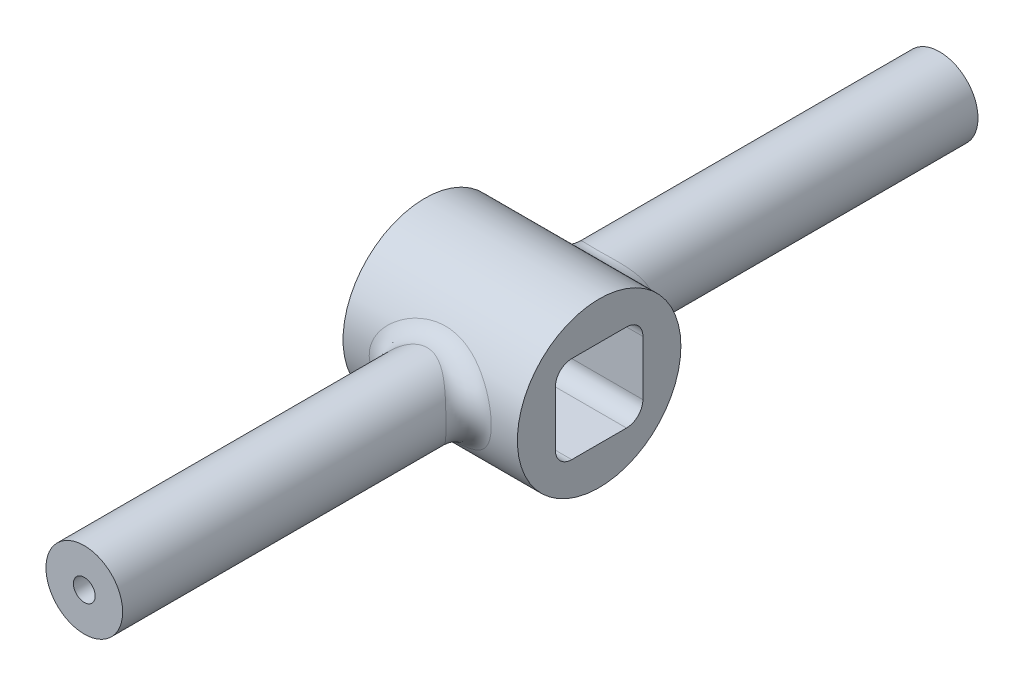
ISO-10303-21;
HEADER;
FILE_DESCRIPTION(('STEP AP214'),'2;1');
FILE_NAME('part.step','',(''),(''),'','','');
FILE_SCHEMA(('AUTOMOTIVE_DESIGN { 1 0 10303 214 1 1 1 1 }'));
ENDSEC;
DATA;
#1=APPLICATION_CONTEXT('core data for automotive mechanical design processes');
#2=APPLICATION_PROTOCOL_DEFINITION('international standard','automotive_design',2000,#1);
#3=PRODUCT_CONTEXT('',#1,'mechanical');
#4=PRODUCT('Part','Part','',(#3));
#5=PRODUCT_RELATED_PRODUCT_CATEGORY('part','',(#4));
#6=PRODUCT_DEFINITION_FORMATION('','',#4);
#7=PRODUCT_DEFINITION_CONTEXT('part definition',#1,'design');
#8=PRODUCT_DEFINITION('design','',#6,#7);
#9=PRODUCT_DEFINITION_SHAPE('','',#8);
#10=(LENGTH_UNIT() NAMED_UNIT(*) SI_UNIT(.MILLI.,.METRE.));
#11=(NAMED_UNIT(*) PLANE_ANGLE_UNIT() SI_UNIT($,.RADIAN.));
#12=(NAMED_UNIT(*) SI_UNIT($,.STERADIAN.) SOLID_ANGLE_UNIT());
#13=UNCERTAINTY_MEASURE_WITH_UNIT(LENGTH_MEASURE(1.E-05),#10,'distance_accuracy_value','');
#14=(GEOMETRIC_REPRESENTATION_CONTEXT(3) GLOBAL_UNCERTAINTY_ASSIGNED_CONTEXT((#13)) GLOBAL_UNIT_ASSIGNED_CONTEXT((#10,
#11,#12)) REPRESENTATION_CONTEXT('',''));
#15=CARTESIAN_POINT('',(0.,0.,0.));
#16=DIRECTION('',(0.,0.,1.));
#17=DIRECTION('',(1.,0.,0.));
#18=AXIS2_PLACEMENT_3D('',#15,#16,#17);
#19=CARTESIAN_POINT('',(0.,0.,62.31382));
#20=DIRECTION('',(0.,0.,-1.));
#21=DIRECTION('',(-1.,0.,0.));
#22=AXIS2_PLACEMENT_3D('',#19,#20,#21);
#23=CYLINDRICAL_SURFACE('',#22,5.588);
#24=CARTESIAN_POINT('',(-5.49908627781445,0.992871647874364,15.1323830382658));
#25=CARTESIAN_POINT('',(-5.55794185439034,0.666896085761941,11.9077104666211));
#26=CARTESIAN_POINT('',(-8.74854635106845,1.23675733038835,11.8482264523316));
#27=CARTESIAN_POINT('',(-5.52543814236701,0.846924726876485,15.1566208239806));
#28=CARTESIAN_POINT('',(-5.56761140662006,0.563725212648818,11.9096170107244));
#29=CARTESIAN_POINT('',(-8.7904697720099,1.05496049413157,11.8672039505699));
#30=CARTESIAN_POINT('',(-5.54603045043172,0.699605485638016,15.1756709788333));
#31=CARTESIAN_POINT('',(-5.57451331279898,0.463168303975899,11.910721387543));
#32=CARTESIAN_POINT('',(-8.82323026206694,0.871454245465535,11.8821196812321));
#33=CARTESIAN_POINT('',(-5.57540577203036,0.403405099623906,15.2028893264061));
#34=CARTESIAN_POINT('',(-5.58412909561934,0.264545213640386,11.9121431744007));
#35=CARTESIAN_POINT('',(-8.86996372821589,0.502496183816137,11.9034308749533));
#36=CARTESIAN_POINT('',(-5.58419003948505,0.254524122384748,15.2110586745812));
#37=CARTESIAN_POINT('',(-5.586819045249,0.166726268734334,11.9124565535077));
#38=CARTESIAN_POINT('',(-8.88393869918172,0.317044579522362,11.9098272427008));
#39=CARTESIAN_POINT('',(-5.58981727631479,-0.0434873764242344,15.2162890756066));
#40=CARTESIAN_POINT('',(-5.58856416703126,-0.0285709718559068,11.9126687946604));
#41=CARTESIAN_POINT('',(-8.89289112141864,-0.0541694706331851,11.9139224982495));
#42=CARTESIAN_POINT('',(-5.58666439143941,-0.192617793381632,15.2133539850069));
#43=CARTESIAN_POINT('',(-5.5876162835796,-0.125805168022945,11.9125672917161));
#44=CARTESIAN_POINT('',(-8.88787516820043,-0.239931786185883,11.9116244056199));
#45=CARTESIAN_POINT('',(-5.56847559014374,-0.48989813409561,15.1964668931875));
#46=CARTESIAN_POINT('',(-5.58186238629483,-0.322260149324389,11.9118110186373));
#47=CARTESIAN_POINT('',(-8.85893843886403,-0.610235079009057,11.8984022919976));
#48=CARTESIAN_POINT('',(-5.55344008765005,-0.638048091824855,15.1825152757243));
#49=CARTESIAN_POINT('',(-5.57707087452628,-0.421235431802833,11.9111582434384));
#50=CARTESIAN_POINT('',(-8.83501832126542,-0.794776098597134,11.8874785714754));
#51=CARTESIAN_POINT('',(-5.51348446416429,-0.91961587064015,15.1456172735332));
#52=CARTESIAN_POINT('',(-5.5632720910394,-0.614576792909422,11.9087808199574));
#53=CARTESIAN_POINT('',(-8.77145255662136,-1.14550724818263,11.8585884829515));
#54=CARTESIAN_POINT('',(-5.48951441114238,-1.05321449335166,15.1235373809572));
#55=CARTESIAN_POINT('',(-5.55469014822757,-0.708386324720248,11.907158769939));
#56=CARTESIAN_POINT('',(-8.73331838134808,-1.31192259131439,11.841300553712));
#57=CARTESIAN_POINT('',(-5.43210178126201,-1.31770848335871,15.0709788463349));
#58=CARTESIAN_POINT('',(-5.53235272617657,-0.900247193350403,11.9022140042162));
#59=CARTESIAN_POINT('',(-8.64198010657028,-1.6413860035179,11.8001487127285));
#60=CARTESIAN_POINT('',(-5.39865626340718,-1.44860299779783,15.0404975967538));
#61=CARTESIAN_POINT('',(-5.5186444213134,-0.998109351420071,11.8989047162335));
#62=CARTESIAN_POINT('',(-8.58877132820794,-1.80443301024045,11.7762827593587));
#63=CARTESIAN_POINT('',(-5.28463443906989,-1.83594075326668,14.9373953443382));
#64=CARTESIAN_POINT('',(-5.46796210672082,-1.29772764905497,11.8852432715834));
#65=CARTESIAN_POINT('',(-8.40737297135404,-2.28691512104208,11.6955566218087));
#66=CARTESIAN_POINT('',(-5.19033973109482,-2.08726691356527,14.8530842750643));
#67=CARTESIAN_POINT('',(-5.42150186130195,-1.50672867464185,11.871214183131));
#68=CARTESIAN_POINT('',(-8.25735866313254,-2.59997620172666,11.6295434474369));
#69=CARTESIAN_POINT('',(-4.96291856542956,-2.58333582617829,14.6549534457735));
#70=CARTESIAN_POINT('',(-5.28862778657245,-1.95176518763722,11.8262004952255));
#71=CARTESIAN_POINT('',(-7.89555226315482,-3.21789782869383,11.4744126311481));
#72=CARTESIAN_POINT('',(-4.82801684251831,-2.82704421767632,14.5398193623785));
#73=CARTESIAN_POINT('',(-5.20124131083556,-2.18759713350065,11.7947755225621));
#74=CARTESIAN_POINT('',(-7.68093588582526,-3.52146993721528,11.3842659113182));
#75=CARTESIAN_POINT('',(-4.52572468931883,-3.28936775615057,14.2915968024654));
#76=CARTESIAN_POINT('',(-4.9782507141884,-2.66447685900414,11.7123057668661));
#77=CARTESIAN_POINT('',(-7.20001655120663,-4.09735708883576,11.1899146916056));
#78=CARTESIAN_POINT('',(-4.35831862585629,-3.50797074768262,14.1584996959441));
#79=CARTESIAN_POINT('',(-4.84388748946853,-2.90498055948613,11.6617584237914));
#80=CARTESIAN_POINT('',(-6.9336887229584,-4.36965699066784,11.0857034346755));
#81=CARTESIAN_POINT('',(-3.97077363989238,-3.94390476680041,13.866331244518));
#82=CARTESIAN_POINT('',(-4.50421793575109,-3.40645426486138,11.5365960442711));
#83=CARTESIAN_POINT('',(-6.31713988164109,-4.91267238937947,10.8569438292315));
#84=CARTESIAN_POINT('',(-3.74661131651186,-4.15739303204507,13.7061300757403));
#85=CARTESIAN_POINT('',(-4.29290024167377,-3.66718407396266,11.4599902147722));
#86=CARTESIAN_POINT('',(-5.96051800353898,-5.17860120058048,10.7315108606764));
#87=CARTESIAN_POINT('',(-3.38579531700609,-4.44815426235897,13.469814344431));
#88=CARTESIAN_POINT('',(-3.92775020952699,-4.03604615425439,11.3367986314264));
#89=CARTESIAN_POINT('',(-5.38649254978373,-5.54078405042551,10.5464823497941));
#90=CARTESIAN_POINT('',(-3.2612981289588,-4.54023611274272,13.3916345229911));
#91=CARTESIAN_POINT('',(-3.79907811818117,-4.15458078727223,11.2946748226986));
#92=CARTESIAN_POINT('',(-5.18842884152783,-5.65548457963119,10.4852697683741));
#93=CARTESIAN_POINT('',(-3.00445176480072,-4.71413335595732,13.238678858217));
#94=CARTESIAN_POINT('',(-3.52720891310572,-4.3815125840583,11.2097640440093));
#95=CARTESIAN_POINT('',(-4.77980962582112,-5.87209736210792,10.3655098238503));
#96=CARTESIAN_POINT('',(-2.87210112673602,-4.79594682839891,13.1639036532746));
#97=CARTESIAN_POINT('',(-3.38405013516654,-4.4901104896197,11.1669485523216));
#98=CARTESIAN_POINT('',(-4.56925179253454,-5.97400722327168,10.3069629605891));
#99=CARTESIAN_POINT('',(-2.59146299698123,-4.95354246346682,13.015460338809));
#100=CARTESIAN_POINT('',(-3.07477022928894,-4.70145452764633,11.0799867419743));
#101=CARTESIAN_POINT('',(-4.12278204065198,-6.17031412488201,10.1907360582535));
#102=CARTESIAN_POINT('',(-2.44269711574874,-5.02861308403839,12.9421631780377));
#103=CARTESIAN_POINT('',(-2.9076349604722,-4.80372369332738,11.0358336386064));
#104=CARTESIAN_POINT('',(-3.88610904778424,-6.26382484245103,10.1333464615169));
#105=CARTESIAN_POINT('',(-2.13770361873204,-5.16564535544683,12.8048405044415));
#106=CARTESIAN_POINT('',(-2.55969294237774,-4.99188792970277,10.9516299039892));
#107=CARTESIAN_POINT('',(-3.40089212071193,-6.43451726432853,10.0258267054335));
#108=CARTESIAN_POINT('',(-1.9814803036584,-5.22761445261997,12.7408097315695));
#109=CARTESIAN_POINT('',(-2.37876655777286,-5.0780682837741,10.9114815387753));
#110=CARTESIAN_POINT('',(-3.15235502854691,-6.51170824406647,9.97569242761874));
#111=CARTESIAN_POINT('',(-1.66274226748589,-5.33754612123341,12.6249208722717));
#112=CARTESIAN_POINT('',(-2.00550868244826,-5.23173824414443,10.8379342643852));
#113=CARTESIAN_POINT('',(-2.64527178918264,-6.64864316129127,9.88495473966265));
#114=CARTESIAN_POINT('',(-1.50023885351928,-5.3855326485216,12.5730419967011));
#115=CARTESIAN_POINT('',(-1.81297543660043,-5.29951646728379,10.8044165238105));
#116=CARTESIAN_POINT('',(-2.38674363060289,-6.70841693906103,9.84433505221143));
#117=CARTESIAN_POINT('',(-1.17004179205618,-5.46677481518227,12.4839888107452));
#118=CARTESIAN_POINT('',(-1.41887470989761,-5.41456510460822,10.7464755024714));
#119=CARTESIAN_POINT('',(-1.86143012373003,-6.80961516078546,9.77460893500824));
#120=CARTESIAN_POINT('',(-1.00234962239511,-5.50003460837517,12.446810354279));
#121=CARTESIAN_POINT('',(-1.21699507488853,-5.46205561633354,10.7219482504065));
#122=CARTESIAN_POINT('',(-1.59464712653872,-6.85104477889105,9.74549925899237));
#123=CARTESIAN_POINT('',(-0.687585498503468,-5.54748475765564,12.3933705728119));
#124=CARTESIAN_POINT('',(-0.836472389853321,-5.52985044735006,10.6865912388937));
#125=CARTESIAN_POINT('',(-1.09388602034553,-6.91015042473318,9.70365742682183));
#126=CARTESIAN_POINT('',(-0.540967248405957,-5.56371247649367,12.3748885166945));
#127=CARTESIAN_POINT('',(-0.658412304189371,-5.55314539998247,10.6742663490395));
#128=CARTESIAN_POINT('',(-0.860629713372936,-6.9303642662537,9.68918650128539));
#129=CARTESIAN_POINT('',(-0.246485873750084,-5.58451130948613,12.3511551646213));
#130=CARTESIAN_POINT('',(-0.300359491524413,-5.5829742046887,10.6584458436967));
#131=CARTESIAN_POINT('',(-0.392136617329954,-6.95627205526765,9.67060396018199));
#132=CARTESIAN_POINT('',(-0.0986228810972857,-5.58908364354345,12.3459024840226));
#133=CARTESIAN_POINT('',(-0.120095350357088,-5.58955562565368,10.6549250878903));
#134=CARTESIAN_POINT('',(-0.156900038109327,-6.96196752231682,9.66649126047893));
#135=CARTESIAN_POINT('',(0.196905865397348,-5.58648419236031,12.3488795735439));
#136=CARTESIAN_POINT('',(0.239827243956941,-5.58582353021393,10.6569137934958));
#137=CARTESIAN_POINT('',(0.313259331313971,-6.9587295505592,9.66882223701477));
#138=CARTESIAN_POINT('',(0.344571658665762,-5.5793152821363,12.3571060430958));
#139=CARTESIAN_POINT('',(0.419765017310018,-5.57550835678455,10.662424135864));
#140=CARTESIAN_POINT('',(0.548182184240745,-6.94979969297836,9.67526332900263));
#141=CARTESIAN_POINT('',(0.638348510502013,-5.55337729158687,12.3866423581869));
#142=CARTESIAN_POINT('',(0.776621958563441,-5.5383321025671,10.6820892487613));
#143=CARTESIAN_POINT('',(1.01555444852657,-6.91749038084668,9.69838942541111));
#144=CARTESIAN_POINT('',(0.784459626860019,-5.53460864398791,12.4079517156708));
#145=CARTESIAN_POINT('',(0.953808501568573,-5.51141490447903,10.6962735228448));
#146=CARTESIAN_POINT('',(1.24800395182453,-6.89411146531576,9.71507404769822));
#147=CARTESIAN_POINT('',(1.0551803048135,-5.48895964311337,12.4591455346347));
#148=CARTESIAN_POINT('',(1.28031798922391,-5.44631128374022,10.7300426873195));
#149=CARTESIAN_POINT('',(1.67869593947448,-6.83724939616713,9.75515735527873));
#150=CARTESIAN_POINT('',(1.18013207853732,-5.46343807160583,12.4875691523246));
#151=CARTESIAN_POINT('',(1.43051443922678,-5.40994330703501,10.7487370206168));
#152=CARTESIAN_POINT('',(1.87748285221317,-6.80545879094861,9.77741224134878));
#153=CARTESIAN_POINT('',(1.42721518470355,-5.4041613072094,12.5526814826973));
#154=CARTESIAN_POINT('',(1.72571108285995,-5.32594398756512,10.7911579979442));
#155=CARTESIAN_POINT('',(2.27056961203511,-6.73162147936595,9.82839334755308));
#156=CARTESIAN_POINT('',(1.54934561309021,-5.37040351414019,12.5893728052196));
#157=CARTESIAN_POINT('',(1.87084274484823,-5.27822150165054,10.8149279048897));
#158=CARTESIAN_POINT('',(2.46486802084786,-6.68957153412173,9.85712161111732));
#159=CARTESIAN_POINT('',(1.91054643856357,-5.2572939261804,12.7102553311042));
#160=CARTESIAN_POINT('',(2.29770698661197,-5.11897585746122,10.892517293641));
#161=CARTESIAN_POINT('',(3.0395056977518,-6.54867808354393,9.9517691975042));
#162=CARTESIAN_POINT('',(2.14457310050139,-5.16608067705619,12.8052849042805));
#163=CARTESIAN_POINT('',(2.56962749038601,-4.991481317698,10.9525344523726));
#164=CARTESIAN_POINT('',(3.41182084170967,-6.4350595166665,10.0261746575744));
#165=CARTESIAN_POINT('',(2.62071455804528,-4.94311397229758,13.0264764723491));
#166=CARTESIAN_POINT('',(3.11031802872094,-4.68621445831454,11.0872843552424));
#167=CARTESIAN_POINT('',(4.1693186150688,-6.15732401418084,10.1993613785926));
#168=CARTESIAN_POINT('',(2.86079123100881,-4.8079604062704,13.1549350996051));
#169=CARTESIAN_POINT('',(3.37533202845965,-4.50345490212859,11.1631975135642));
#170=CARTESIAN_POINT('',(4.55125877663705,-5.98897177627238,10.2999408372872));
#171=CARTESIAN_POINT('',(3.31698316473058,-4.50536765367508,13.4233050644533));
#172=CARTESIAN_POINT('',(3.86069464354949,-4.10721000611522,11.3131899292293));
#173=CARTESIAN_POINT('',(5.27701867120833,-5.61205114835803,10.5100669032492));
#174=CARTESIAN_POINT('',(3.53308033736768,-4.33790435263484,13.5632249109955));
#175=CARTESIAN_POINT('',(4.08081773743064,-3.89257123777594,11.3874377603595));
#176=CARTESIAN_POINT('',(5.62080962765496,-5.40345272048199,10.6196201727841));
#177=CARTESIAN_POINT('',(3.97341570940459,-3.94205265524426,13.8670558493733));
#178=CARTESIAN_POINT('',(4.50784421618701,-3.40515409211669,11.5370921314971));
#179=CARTESIAN_POINT('',(6.321343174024,-4.91036533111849,10.8575111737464));
#180=CARTESIAN_POINT('',(4.19271409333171,-3.70814214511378,14.0309733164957));
#181=CARTESIAN_POINT('',(4.70396891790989,-3.12866389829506,11.6099878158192));
#182=CARTESIAN_POINT('',(6.67022696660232,-4.6189978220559,10.9858538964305));
#183=CARTESIAN_POINT('',(4.59001200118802,-3.20320347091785,14.342237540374));
#184=CARTESIAN_POINT('',(5.03100416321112,-2.57069578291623,11.7317381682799));
#185=CARTESIAN_POINT('',(7.30229182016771,-3.99002769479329,11.2295649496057));
#186=CARTESIAN_POINT('',(4.76800067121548,-2.9321655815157,14.4895799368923));
#187=CARTESIAN_POINT('',(5.15996770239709,-2.28932104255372,11.7798745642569));
#188=CARTESIAN_POINT('',(7.58545561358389,-3.65241296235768,11.3449298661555));
#189=CARTESIAN_POINT('',(4.99942078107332,-2.50166440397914,14.6867780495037));
#190=CARTESIAN_POINT('',(5.30947623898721,-1.88059933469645,11.8332357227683));
#191=CARTESIAN_POINT('',(7.95362396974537,-3.11616491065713,11.4993303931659));
#192=CARTESIAN_POINT('',(5.07076904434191,-2.35376756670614,14.7486679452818));
#193=CARTESIAN_POINT('',(5.3521398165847,-1.7452879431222,11.847909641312));
#194=CARTESIAN_POINT('',(8.06713257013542,-2.93193918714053,11.5477884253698));
#195=CARTESIAN_POINT('',(5.20058937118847,-2.05102213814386,14.862638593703));
#196=CARTESIAN_POINT('',(5.42468552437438,-1.48027487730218,11.8718030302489));
#197=CARTESIAN_POINT('',(8.27366490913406,-2.55482838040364,11.637024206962));
#198=CARTESIAN_POINT('',(5.25906814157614,-1.89617721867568,14.9147244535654));
#199=CARTESIAN_POINT('',(5.45436719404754,-1.35085230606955,11.8809427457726));
#200=CARTESIAN_POINT('',(8.36669931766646,-2.36194787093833,11.6778059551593));
#201=CARTESIAN_POINT('',(5.3622960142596,-1.58083291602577,15.0074669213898));
#202=CARTESIAN_POINT('',(5.50319487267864,-1.09866021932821,11.8949662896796));
#203=CARTESIAN_POINT('',(8.53092547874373,-1.96914344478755,11.7504206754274));
#204=CARTESIAN_POINT('',(5.4070582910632,-1.42033912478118,15.0481344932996));
#205=CARTESIAN_POINT('',(5.52219552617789,-0.976220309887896,11.899797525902));
#206=CARTESIAN_POINT('',(8.60213819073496,-1.76922649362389,11.7822622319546));
#207=CARTESIAN_POINT('',(5.48220911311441,-1.09498022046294,15.1167963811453));
#208=CARTESIAN_POINT('',(5.55215551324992,-0.737433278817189,11.9067070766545));
#209=CARTESIAN_POINT('',(8.72169631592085,-1.36394751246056,11.8360225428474));
#210=CARTESIAN_POINT('',(5.5126007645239,-0.930116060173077,15.1447934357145));
#211=CARTESIAN_POINT('',(5.56301706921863,-0.621443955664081,11.9087563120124));
#212=CARTESIAN_POINT('',(8.7700466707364,-1.15858666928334,11.8579434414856));
#213=CARTESIAN_POINT('',(5.5545319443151,-0.626282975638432,15.1835309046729));
#214=CARTESIAN_POINT('',(5.57740263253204,-0.413434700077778,11.9111966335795));
#215=CARTESIAN_POINT('',(8.83675536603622,-0.780121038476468,11.8882737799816));
#216=CARTESIAN_POINT('',(5.56841555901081,-0.487739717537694,15.1964117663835));
#217=CARTESIAN_POINT('',(5.58183961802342,-0.320880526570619,11.911806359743));
#218=CARTESIAN_POINT('',(8.85884293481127,-0.607546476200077,11.8983591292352));
#219=CARTESIAN_POINT('',(5.5857989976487,-0.209736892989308,15.2125499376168));
#220=CARTESIAN_POINT('',(5.58734572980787,-0.137092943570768,11.9125333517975));
#221=CARTESIAN_POINT('',(8.88649840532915,-0.26125596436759,11.9109948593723));
#222=CARTESIAN_POINT('',(5.58929614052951,-0.0702770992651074,15.2158047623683));
#223=CARTESIAN_POINT('',(5.58840193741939,-0.046060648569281,11.9126488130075));
#224=CARTESIAN_POINT('',(8.8920620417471,-0.0875397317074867,11.9135432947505));
#225=CARTESIAN_POINT('',(5.58585046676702,0.208386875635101,15.2126019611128));
#226=CARTESIAN_POINT('',(5.58733404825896,0.136463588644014,11.9125193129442));
#227=CARTESIAN_POINT('',(8.8865802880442,0.259574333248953,11.9110355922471));
#228=CARTESIAN_POINT('',(5.57891365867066,0.347591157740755,15.2061499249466));
#229=CARTESIAN_POINT('',(5.58521408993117,0.227755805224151,11.9122748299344));
#230=CARTESIAN_POINT('',(8.87554445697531,0.432972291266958,11.9059838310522));
#231=CARTESIAN_POINT('',(5.55470005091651,0.624839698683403,15.1836979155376));
#232=CARTESIAN_POINT('',(5.57738460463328,0.412698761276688,11.9111627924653));
#233=CARTESIAN_POINT('',(8.83702280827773,0.77832323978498,11.8884045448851));
#234=CARTESIAN_POINT('',(5.53741932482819,0.762883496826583,15.1676943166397));
#235=CARTESIAN_POINT('',(5.57169099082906,0.506148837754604,11.9102977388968));
#236=CARTESIAN_POINT('',(8.80953074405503,0.95027565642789,11.8758741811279));
#237=CARTESIAN_POINT('',(5.49278254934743,1.03645603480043,15.1265595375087));
#238=CARTESIAN_POINT('',(5.55579264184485,0.696628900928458,11.9073440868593));
#239=CARTESIAN_POINT('',(8.73851769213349,1.29104764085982,11.8436668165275));
#240=CARTESIAN_POINT('',(5.46545003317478,1.17198987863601,15.101449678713));
#241=CARTESIAN_POINT('',(5.5456344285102,0.793445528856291,11.9052667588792));
#242=CARTESIAN_POINT('',(8.69503414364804,1.45987356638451,11.8240065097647));
#243=CARTESIAN_POINT('',(5.40103647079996,1.43999156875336,15.0426816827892));
#244=CARTESIAN_POINT('',(5.51953253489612,0.991691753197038,11.8990930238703));
#245=CARTESIAN_POINT('',(8.59255802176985,1.793706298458,11.7779928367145));
#246=CARTESIAN_POINT('',(5.36395170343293,1.57245822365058,15.0090202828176));
#247=CARTESIAN_POINT('',(5.5036457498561,1.09292229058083,11.8950139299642));
#248=CARTESIAN_POINT('',(8.53355952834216,1.95871162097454,11.7516369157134));
#249=CARTESIAN_POINT('',(5.23865383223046,1.96397249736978,14.8962745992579));
#250=CARTESIAN_POINT('',(5.44537181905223,1.4028326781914,11.8784889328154));
#251=CARTESIAN_POINT('',(8.33422200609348,2.44639615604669,11.6633602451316));
#252=CARTESIAN_POINT('',(5.13636413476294,2.21733290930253,14.8053974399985));
#253=CARTESIAN_POINT('',(5.39242924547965,1.61914823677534,11.8618157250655));
#254=CARTESIAN_POINT('',(8.17148839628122,2.76199117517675,11.5922060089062));
#255=CARTESIAN_POINT('',(4.89329874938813,2.71307998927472,14.5954648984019));
#256=CARTESIAN_POINT('',(5.24390854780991,2.07555035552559,11.8102830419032));
#257=CARTESIAN_POINT('',(7.78479346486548,3.37951191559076,11.4278347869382));
#258=CARTESIAN_POINT('',(4.75113285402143,2.95460737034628,14.4754178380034));
#259=CARTESIAN_POINT('',(5.14777956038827,2.31523378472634,11.7751661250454));
#260=CARTESIAN_POINT('',(7.5586204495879,3.68036727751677,11.3338413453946));
#261=CARTESIAN_POINT('',(4.43440317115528,3.4116241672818,14.2187957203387));
#262=CARTESIAN_POINT('',(4.90561125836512,2.79729324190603,11.6851494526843));
#263=CARTESIAN_POINT('',(7.05473231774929,4.24964415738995,11.1329135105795));
#264=CARTESIAN_POINT('',(4.25981812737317,3.6270963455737,14.0822098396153));
#265=CARTESIAN_POINT('',(4.76083062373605,3.03926450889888,11.6307443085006));
#266=CARTESIAN_POINT('',(6.7769833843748,4.51804420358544,11.0259706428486));
#267=CARTESIAN_POINT('',(3.85664482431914,4.0558295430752,13.7842682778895));
#268=CARTESIAN_POINT('',(4.3978307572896,3.54122461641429,11.4981714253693));
#269=CARTESIAN_POINT('',(6.13557131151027,5.05208999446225,10.792690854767));
#270=CARTESIAN_POINT('',(3.62396571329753,4.26501098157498,13.6220292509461));
#271=CARTESIAN_POINT('',(4.17324423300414,3.80072730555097,11.4180184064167));
#272=CARTESIAN_POINT('',(5.76539999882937,5.31265406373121,10.6656622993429));
#273=CARTESIAN_POINT('',(3.12558196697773,4.64265886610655,13.3058497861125));
#274=CARTESIAN_POINT('',(3.66185081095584,4.28330686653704,11.2497187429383));
#275=CARTESIAN_POINT('',(4.97251676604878,5.78306611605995,10.4181027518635));
#276=CARTESIAN_POINT('',(2.85987606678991,4.81112375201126,13.1519096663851));
#277=CARTESIAN_POINT('',(3.37572359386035,4.50787524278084,11.1615159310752));
#278=CARTESIAN_POINT('',(4.54980283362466,5.99291215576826,10.2975720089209));
#279=CARTESIAN_POINT('',(2.33353884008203,5.08498473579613,12.8878622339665));
#280=CARTESIAN_POINT('',(2.78706442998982,4.87899596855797,11.0038943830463));
#281=CARTESIAN_POINT('',(3.71244815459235,6.33404343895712,10.0908303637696));
#282=CARTESIAN_POINT('',(2.07625690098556,5.1955728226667,12.7746971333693));
#283=CARTESIAN_POINT('',(2.49107715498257,5.03273789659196,10.9332599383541));
#284=CARTESIAN_POINT('',(3.30313597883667,6.47179601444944,10.002225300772));
#285=CARTESIAN_POINT('',(1.67698816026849,5.33228709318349,12.6304064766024));
#286=CARTESIAN_POINT('',(2.02191421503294,5.22450227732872,10.8413531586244));
#287=CARTESIAN_POINT('',(2.66793570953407,6.64209232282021,9.88924981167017));
#288=CARTESIAN_POINT('',(1.5416775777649,5.37299659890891,12.586553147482));
#289=CARTESIAN_POINT('',(1.86183015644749,5.28189690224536,10.8130975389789));
#290=CARTESIAN_POINT('',(2.45266887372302,6.69280157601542,9.85491389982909));
#291=CARTESIAN_POINT('',(1.26731937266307,5.44423558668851,12.5088351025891));
#292=CARTESIAN_POINT('',(1.53510829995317,5.38262282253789,10.7626786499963));
#293=CARTESIAN_POINT('',(2.01618991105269,6.78153947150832,9.79406287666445));
#294=CARTESIAN_POINT('',(1.12827350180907,5.47476975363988,12.4749657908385));
#295=CARTESIAN_POINT('',(1.36829814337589,5.4260892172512,10.7404525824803));
#296=CARTESIAN_POINT('',(1.79498057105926,6.81957394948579,9.76754416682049));
#297=CARTESIAN_POINT('',(0.846352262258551,5.52540434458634,12.4183368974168));
#298=CARTESIAN_POINT('',(1.02865022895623,5.49825573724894,10.7031527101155));
#299=CARTESIAN_POINT('',(1.34646950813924,6.88264625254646,9.72320535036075));
#300=CARTESIAN_POINT('',(0.703456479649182,5.54542776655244,12.3956593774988));
#301=CARTESIAN_POINT('',(0.855554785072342,5.52694819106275,10.6880810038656));
#302=CARTESIAN_POINT('',(1.1191353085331,6.90758816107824,9.70544949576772));
#303=CARTESIAN_POINT('',(0.415972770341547,5.57436783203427,12.3627624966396));
#304=CARTESIAN_POINT('',(0.506616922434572,5.56840450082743,10.6662011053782));
#305=CARTESIAN_POINT('',(0.661774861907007,6.94363696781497,9.67969217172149));
#306=CARTESIAN_POINT('',(0.271384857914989,5.5832845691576,12.3525430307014));
#307=CARTESIAN_POINT('',(0.330526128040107,5.58122896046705,10.6593612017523));
#308=CARTESIAN_POINT('',(0.431748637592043,6.95474398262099,9.67169062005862));
#309=CARTESIAN_POINT('',(-0.0181487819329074,5.5898460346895,12.3450301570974));
#310=CARTESIAN_POINT('',(-0.0220431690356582,5.59064917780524,10.6543431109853));
#311=CARTESIAN_POINT('',(-0.0288730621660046,6.96291718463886,9.66580825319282));
#312=CARTESIAN_POINT('',(-0.163094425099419,5.58749320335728,12.3477339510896));
#313=CARTESIAN_POINT('',(-0.198783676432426,5.5872624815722,10.656155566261));
#314=CARTESIAN_POINT('',(-0.25946840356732,6.95998641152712,9.66792524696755));
#315=CARTESIAN_POINT('',(-0.452037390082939,5.57156539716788,12.3659365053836));
#316=CARTESIAN_POINT('',(-0.550333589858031,5.56440848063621,10.6683002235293));
#317=CARTESIAN_POINT('',(-0.719150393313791,6.94014615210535,9.68217733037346));
#318=CARTESIAN_POINT('',(-0.596034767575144,5.55799108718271,12.3814345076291));
#319=CARTESIAN_POINT('',(-0.725401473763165,5.54490828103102,10.6786498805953));
#320=CARTESIAN_POINT('',(-0.948237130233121,6.92323749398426,9.69431182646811));
#321=CARTESIAN_POINT('',(-0.866036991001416,5.52197168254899,12.4221454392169));
#322=CARTESIAN_POINT('',(-1.05222990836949,5.49340926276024,10.7056313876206));
#323=CARTESIAN_POINT('',(-1.37778612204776,6.87837040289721,9.72618733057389));
#324=CARTESIAN_POINT('',(-0.992272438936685,5.50067197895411,12.4460962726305));
#325=CARTESIAN_POINT('',(-1.20464708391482,5.46296452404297,10.7214762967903));
#326=CARTESIAN_POINT('',(-1.57861524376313,6.85183871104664,9.74494015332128));
#327=CARTESIAN_POINT('',(-1.24225841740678,5.44966353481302,12.5027589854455));
#328=CARTESIAN_POINT('',(-1.50489228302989,5.39042164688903,10.7586474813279));
#329=CARTESIAN_POINT('',(-1.97632020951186,6.78830072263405,9.7893054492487));
#330=CARTESIAN_POINT('',(-1.36600811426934,5.41995202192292,12.5354737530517));
#331=CARTESIAN_POINT('',(-1.65286481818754,5.34824147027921,10.7800139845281));
#332=CARTESIAN_POINT('',(-2.17319472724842,6.75129097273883,9.81492018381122));
#333=CARTESIAN_POINT('',(-1.73248956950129,5.31868141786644,12.6452934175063));
#334=CARTESIAN_POINT('',(-2.08893567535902,5.20500551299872,10.8511437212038));
#335=CARTESIAN_POINT('',(-2.75623340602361,6.6251445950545,9.90090586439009));
#336=CARTESIAN_POINT('',(-1.9705885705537,5.23496783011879,12.7340957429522));
#337=CARTESIAN_POINT('',(-2.36815311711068,5.08725835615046,10.9079132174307));
#338=CARTESIAN_POINT('',(-3.13502727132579,6.52086788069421,9.97043556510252));
#339=CARTESIAN_POINT('',(-2.45049263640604,5.02941370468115,12.9423021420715));
#340=CARTESIAN_POINT('',(-2.91908670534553,4.80375434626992,11.0365944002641));
#341=CARTESIAN_POINT('',(-3.89851101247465,6.26482212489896,10.1334552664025));
#342=CARTESIAN_POINT('',(-2.69076872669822,4.90485939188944,13.0637158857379));
#343=CARTESIAN_POINT('',(-3.18822813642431,4.63371087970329,11.1097324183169));
#344=CARTESIAN_POINT('',(-4.28076842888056,6.1096727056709,10.2285187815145));
#345=CARTESIAN_POINT('',(-3.14892445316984,4.62409435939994,13.320365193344));
#346=CARTESIAN_POINT('',(-3.68460730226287,4.26149786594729,11.2566929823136));
#347=CARTESIAN_POINT('',(-5.00965253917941,5.75994148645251,10.4294679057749));
#348=CARTESIAN_POINT('',(-3.36678939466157,4.46786306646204,13.4556097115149));
#349=CARTESIAN_POINT('',(-3.91178898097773,4.05819016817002,11.3307420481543));
#350=CARTESIAN_POINT('',(-5.35625585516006,5.56533405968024,10.5353605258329));
#351=CARTESIAN_POINT('',(-3.81442364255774,4.09574922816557,13.7533543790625));
#352=CARTESIAN_POINT('',(-4.35838565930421,3.59123730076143,11.4832020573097));
#353=CARTESIAN_POINT('',(-6.06840124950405,5.10181541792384,10.7684861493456));
#354=CARTESIAN_POINT('',(-4.03935374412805,3.87419551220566,13.9164032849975));
#355=CARTESIAN_POINT('',(-4.56728677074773,3.32307009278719,11.5596132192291));
#356=CARTESIAN_POINT('',(-6.42624459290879,4.82583998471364,10.8961488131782));
#357=CARTESIAN_POINT('',(-4.45037776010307,3.39405288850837,14.2301846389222));
#358=CARTESIAN_POINT('',(-4.92117769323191,2.77686202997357,11.6905614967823));
#359=CARTESIAN_POINT('',(-7.08014643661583,4.22775672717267,11.1418307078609));
#360=CARTESIAN_POINT('',(-4.63645310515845,3.13544637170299,14.3809111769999));
#361=CARTESIAN_POINT('',(-5.06439560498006,2.49858425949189,11.7444915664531));
#362=CARTESIAN_POINT('',(-7.37617539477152,3.90562696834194,11.2598453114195));
#363=CARTESIAN_POINT('',(-4.88435526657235,2.71955633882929,14.5883785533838));
#364=CARTESIAN_POINT('',(-5.23582733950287,2.08725484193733,11.8070991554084));
#365=CARTESIAN_POINT('',(-7.77056519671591,3.38757909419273,11.4222863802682));
#366=CARTESIAN_POINT('',(-4.9626980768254,2.57389529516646,14.6552710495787));
#367=CARTESIAN_POINT('',(-5.28629656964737,1.94810579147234,11.8250814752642));
#368=CARTESIAN_POINT('',(-7.89520148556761,3.20613835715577,11.4746613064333));
#369=CARTESIAN_POINT('',(-5.10664236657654,2.27495601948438,14.779897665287));
#370=CARTESIAN_POINT('',(-5.37316370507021,1.67470826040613,11.8550135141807));
#371=CARTESIAN_POINT('',(-8.12420376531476,2.8337686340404,11.5722404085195));
#372=CARTESIAN_POINT('',(-5.17225010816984,2.12168157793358,14.8376362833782));
#373=CARTESIAN_POINT('',(-5.40933334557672,1.54071109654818,11.8668705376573));
#374=CARTESIAN_POINT('',(-8.22857971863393,2.64284436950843,11.6174481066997));
#375=CARTESIAN_POINT('',(-5.28982523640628,1.80870714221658,14.9421818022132));
#376=CARTESIAN_POINT('',(-5.46971958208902,1.27920826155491,11.8855694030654));
#377=CARTESIAN_POINT('',(-8.41563105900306,2.25299193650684,11.6993042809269));
#378=CARTESIAN_POINT('',(-5.34180360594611,1.64901244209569,14.9889975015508));
#379=CARTESIAN_POINT('',(-5.49375760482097,1.15202233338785,11.8923427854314));
#380=CARTESIAN_POINT('',(-8.49832391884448,2.05407036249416,11.7359596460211));
#381=CARTESIAN_POINT('',(-5.43138561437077,1.3244316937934,15.070256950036));
#382=CARTESIAN_POINT('',(-5.53244281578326,0.904261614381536,11.9023521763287));
#383=CARTESIAN_POINT('',(-8.64084074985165,1.64976068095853,11.7995834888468));
#384=CARTESIAN_POINT('',(-5.46899180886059,1.15954657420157,15.1047028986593));
#385=CARTESIAN_POINT('',(-5.54696178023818,0.784049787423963,11.9055455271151));
#386=CARTESIAN_POINT('',(-8.70066878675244,1.44437373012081,11.8265536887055));
#387=CARTESIAN_POINT('',(-5.49908627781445,0.992871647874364,15.1323830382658));
#388=CARTESIAN_POINT('',(-5.55794185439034,0.666896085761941,11.9077104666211));
#389=CARTESIAN_POINT('',(-8.74854635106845,1.23675733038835,11.8482264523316));
#390=(BOUNDED_SURFACE() B_SPLINE_SURFACE(3,2,((#24,#25,#26),(#27,#28,#29),(#30,#31,#32),(#33,
#34,#35),(#36,#37,#38),(#39,#40,#41),(#42,#43,#44),(#45,#46,#47),(#48,#49,#50),(#51,#52,#53),
(#54,#55,#56),(#57,#58,#59),(#60,#61,#62),(#63,#64,#65),(#66,#67,#68),(#69,#70,#71),(#72,#73,
#74),(#75,#76,#77),(#78,#79,#80),(#81,#82,#83),(#84,#85,#86),(#87,#88,#89),(#90,#91,#92),(#93,
#94,#95),(#96,#97,#98),(#99,#100,#101),(#102,#103,#104),(#105,#106,#107),(#108,#109,#110),(#111,
#112,#113),(#114,#115,#116),(#117,#118,#119),(#120,#121,#122),(#123,#124,#125),(#126,#127,#128),
(#129,#130,#131),(#132,#133,#134),(#135,#136,#137),(#138,#139,#140),(#141,#142,#143),(#144,#145,
#146),(#147,#148,#149),(#150,#151,#152),(#153,#154,#155),(#156,#157,#158),(#159,#160,#161),
(#162,#163,#164),(#165,#166,#167),(#168,#169,#170),(#171,#172,#173),(#174,#175,#176),(#177,#178,
#179),(#180,#181,#182),(#183,#184,#185),(#186,#187,#188),(#189,#190,#191),(#192,#193,#194),
(#195,#196,#197),(#198,#199,#200),(#201,#202,#203),(#204,#205,#206),(#207,#208,#209),(#210,#211,
#212),(#213,#214,#215),(#216,#217,#218),(#219,#220,#221),(#222,#223,#224),(#225,#226,#227),
(#228,#229,#230),(#231,#232,#233),(#234,#235,#236),(#237,#238,#239),(#240,#241,#242),(#243,#244,
#245),(#246,#247,#248),(#249,#250,#251),(#252,#253,#254),(#255,#256,#257),(#258,#259,#260),
(#261,#262,#263),(#264,#265,#266),(#267,#268,#269),(#270,#271,#272),(#273,#274,#275),(#276,#277,
#278),(#279,#280,#281),(#282,#283,#284),(#285,#286,#287),(#288,#289,#290),(#291,#292,#293),
(#294,#295,#296),(#297,#298,#299),(#300,#301,#302),(#303,#304,#305),(#306,#307,#308),(#309,#310,
#311),(#312,#313,#314),(#315,#316,#317),(#318,#319,#320),(#321,#322,#323),(#324,#325,#326),
(#327,#328,#329),(#330,#331,#332),(#333,#334,#335),(#336,#337,#338),(#339,#340,#341),(#342,#343,
#344),(#345,#346,#347),(#348,#349,#350),(#351,#352,#353),(#354,#355,#356),(#357,#358,#359),
(#360,#361,#362),(#363,#364,#365),(#366,#367,#368),(#369,#370,#371),(#372,#373,#374),(#375,#376,
#377),(#378,#379,#380),(#381,#382,#383),(#384,#385,#386),(#387,#388,#389)),.UNSPECIFIED.,.T.,
.F.,.F.) B_SPLINE_SURFACE_WITH_KNOTS((4,2,2,2,2,2,2,2,2,2,2,2,2,2,2,2,2,2,2,2,2,2,2,2,2,2,2,2,2,
2,2,2,2,2,2,2,2,2,2,2,2,2,2,2,2,2,2,2,2,2,2,2,2,2,2,2,2,2,2,2,4),(3,3),(0.,0.71127848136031,
1.42248142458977,2.13343739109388,2.84436859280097,3.49479956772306,4.14543264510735,
5.44560481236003,6.81387870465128,8.18281231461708,9.72930675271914,10.5040248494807,
11.2788876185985,12.1028909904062,12.9264247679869,13.7485392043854,14.570421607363,
15.2755836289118,15.9806718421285,16.6855874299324,17.390476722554,18.0044329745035,
18.6185833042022,19.8461754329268,21.211489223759,22.5778259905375,24.1780769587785,
25.7787479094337,26.5831737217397,27.387179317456,28.1904102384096,28.9934674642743,
29.6583387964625,30.3233817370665,30.9880418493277,31.6529544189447,32.3163201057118,
32.9799392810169,34.3062242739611,35.6861933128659,37.0670703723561,38.6310002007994,
40.1949899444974,41.5678142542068,42.2541944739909,42.9402582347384,43.6312803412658,
44.3222966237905,45.0131632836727,45.7039890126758,46.3185120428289,46.9332378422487,
48.1620436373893,49.4993461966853,50.8375200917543,52.4150139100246,53.9932599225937,
54.8067600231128,55.6198590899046,56.4323009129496,57.2445982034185),(0.,1.),
.UNSPECIFIED.) GEOMETRIC_REPRESENTATION_ITEM() RATIONAL_B_SPLINE_SURFACE(((1.,0.713598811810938,
1.),(1.,0.711698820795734,1.),(1.,0.71019375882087,1.),(1.,0.708038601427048,1.),(1.,
0.707388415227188,1.),(1.,0.706972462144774,1.),(1.,0.707206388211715,1.),(1.,0.708547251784,
1.),(1.,0.70965415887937,1.),(1.,0.71256228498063,1.),(1.,0.714296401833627,1.),(1.,
0.718391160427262,1.),(1.,0.720751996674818,1.),(1.,0.728658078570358,1.),(1.,0.735029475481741,
1.),(1.,0.749591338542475,1.),(1.,0.757859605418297,1.),(1.,0.775117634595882,1.),(1.,
0.784107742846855,1.),(1.,0.803200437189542,1.),(1.,0.813296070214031,1.),(1.,0.82768218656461,
1.),(1.,0.832355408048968,1.),(1.,0.841351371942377,1.),(1.,0.845674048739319,1.),(1.,
0.854128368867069,1.),(1.,0.858230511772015,1.),(1.,0.865811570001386,1.),(1.,0.869290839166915,
1.),(1.,0.875518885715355,1.),(1.,0.878268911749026,1.),(1.,0.882952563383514,1.),(1.,
0.884886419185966,1.),(1.,0.887654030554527,1.),(1.,0.888605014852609,1.),(1.,0.88982484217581,
1.),(1.,0.890093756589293,1.),(1.,0.889941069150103,1.),(1.,0.889519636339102,1.),(1.,
0.887999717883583,1.),(1.,0.88690125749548,1.),(1.,0.884243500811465,1.),(1.,0.882761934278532,
1.),(1.,0.879341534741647,1.),(1.,0.877402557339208,1.),(1.,0.870954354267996,1.),(1.,
0.865812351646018,1.),(1.,0.853536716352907,1.),(1.,0.846244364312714,1.),(1.,0.830519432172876,
1.),(1.,0.822086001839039,1.),(1.,0.80316182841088,1.),(1.,0.792566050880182,1.),(1.,
0.771695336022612,1.),(1.,0.761420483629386,1.),(1.,0.747250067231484,1.),(1.,0.74272368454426,
1.),(1.,0.734276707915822,1.),(1.,0.730355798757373,1.),(1.,0.723299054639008,1.),(1.,
0.720162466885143,1.),(1.,0.714827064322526,1.),(1.,0.712628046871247,1.),(1.,0.709573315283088,
1.),(1.,0.708551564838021,1.),(1.,0.707270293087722,1.),(1.,0.707010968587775,1.),(1.,
0.70726568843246,1.),(1.,0.707779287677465,1.),(1.,0.709558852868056,1.),(1.,0.71082510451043,
1.),(1.,0.714057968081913,1.),(1.,0.716022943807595,1.),(1.,0.720581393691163,1.),(1.,
0.723175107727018,1.),(1.,0.731768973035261,1.),(1.,0.738584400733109,1.),(1.,0.753875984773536,
1.),(1.,0.762408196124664,1.),(1.,0.780055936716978,1.),(1.,0.789171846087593,1.),(1.,
0.808409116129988,1.),(1.,0.81850356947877,1.),(1.,0.837509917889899,1.),(1.,0.846421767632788,
1.),(1.,0.861288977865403,1.),(1.,0.867472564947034,1.),(1.,0.875222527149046,1.),(1.,
0.877551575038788,1.),(1.,0.881649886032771,1.),(1.,0.883419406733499,1.),(1.,0.886363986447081,
1.),(1.,0.887534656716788,1.),(1.,0.889229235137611,1.),(1.,0.889753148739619,1.),(1.,
0.890138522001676,1.),(1.,0.890000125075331,1.),(1.,0.889065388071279,1.),(1.,0.888269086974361,
1.),(1.,0.886165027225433,1.),(1.,0.884923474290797,1.),(1.,0.8819658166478,1.),(1.,
0.880249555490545,1.),(1.,0.874438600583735,1.),(1.,0.86968062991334,1.),(1.,0.858249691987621,
1.),(1.,0.85144473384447,1.),(1.,0.836616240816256,1.),(1.,0.828591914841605,1.),(1.,
0.810350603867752,1.),(1.,0.799998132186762,1.),(1.,0.779325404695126,1.),(1.,0.769005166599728,
1.),(1.,0.754344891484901,1.),(1.,0.749530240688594,1.),(1.,0.740428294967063,1.),(1.,
0.73614074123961,1.),(1.,0.728281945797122,1.),(1.,0.724710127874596,1.),(1.,0.7184535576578,
1.),(1.,0.715768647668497,1.),(1.,0.713598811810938,1.))) REPRESENTATION_ITEM('') SURFACE());
#391=CARTESIAN_POINT('',(-5.49908627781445,0.992871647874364,15.1323830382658));
#392=CARTESIAN_POINT('',(-5.52543814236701,0.846924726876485,15.1566208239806));
#393=CARTESIAN_POINT('',(-5.54603045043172,0.699605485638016,15.1756709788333));
#394=CARTESIAN_POINT('',(-5.57540577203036,0.403405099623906,15.2028893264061));
#395=CARTESIAN_POINT('',(-5.58419003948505,0.254524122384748,15.2110586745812));
#396=CARTESIAN_POINT('',(-5.58981727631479,-0.0434873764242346,15.2162890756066));
#397=CARTESIAN_POINT('',(-5.58666439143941,-0.192617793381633,15.2133539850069));
#398=CARTESIAN_POINT('',(-5.56847559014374,-0.48989813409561,15.1964668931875));
#399=CARTESIAN_POINT('',(-5.55344008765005,-0.638048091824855,15.1825152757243));
#400=CARTESIAN_POINT('',(-5.51348446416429,-0.91961587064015,15.1456172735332));
#401=CARTESIAN_POINT('',(-5.48951441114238,-1.05321449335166,15.1235373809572));
#402=CARTESIAN_POINT('',(-5.43210178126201,-1.31770848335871,15.0709788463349));
#403=CARTESIAN_POINT('',(-5.39865626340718,-1.44860299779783,15.0404975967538));
#404=CARTESIAN_POINT('',(-5.28463443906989,-1.83594075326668,14.9373953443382));
#405=CARTESIAN_POINT('',(-5.19033973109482,-2.08726691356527,14.8530842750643));
#406=CARTESIAN_POINT('',(-4.96291856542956,-2.58333582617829,14.6549534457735));
#407=CARTESIAN_POINT('',(-4.82801684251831,-2.82704421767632,14.5398193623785));
#408=CARTESIAN_POINT('',(-4.52572468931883,-3.28936775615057,14.2915968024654));
#409=CARTESIAN_POINT('',(-4.35831862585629,-3.50797074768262,14.1584996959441));
#410=CARTESIAN_POINT('',(-3.97077363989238,-3.94390476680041,13.866331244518));
#411=CARTESIAN_POINT('',(-3.74661131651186,-4.15739303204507,13.7061300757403));
#412=CARTESIAN_POINT('',(-3.38579531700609,-4.44815426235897,13.469814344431));
#413=CARTESIAN_POINT('',(-3.2612981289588,-4.54023611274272,13.3916345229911));
#414=CARTESIAN_POINT('',(-3.00445176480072,-4.71413335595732,13.238678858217));
#415=CARTESIAN_POINT('',(-2.87210112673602,-4.79594682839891,13.1639036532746));
#416=CARTESIAN_POINT('',(-2.59146299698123,-4.95354246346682,13.015460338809));
#417=CARTESIAN_POINT('',(-2.44269711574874,-5.02861308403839,12.9421631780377));
#418=CARTESIAN_POINT('',(-2.13770361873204,-5.16564535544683,12.8048405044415));
#419=CARTESIAN_POINT('',(-1.9814803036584,-5.22761445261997,12.7408097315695));
#420=CARTESIAN_POINT('',(-1.66274226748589,-5.33754612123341,12.6249208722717));
#421=CARTESIAN_POINT('',(-1.50023885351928,-5.3855326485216,12.5730419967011));
#422=CARTESIAN_POINT('',(-1.17004179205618,-5.46677481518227,12.4839888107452));
#423=CARTESIAN_POINT('',(-1.00234962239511,-5.50003460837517,12.446810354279));
#424=CARTESIAN_POINT('',(-0.687585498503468,-5.54748475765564,12.3933705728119));
#425=CARTESIAN_POINT('',(-0.540967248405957,-5.56371247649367,12.3748885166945));
#426=CARTESIAN_POINT('',(-0.246485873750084,-5.58451130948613,12.3511551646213));
#427=CARTESIAN_POINT('',(-0.098622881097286,-5.58908364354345,12.3459024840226));
#428=CARTESIAN_POINT('',(0.196905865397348,-5.58648419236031,12.3488795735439));
#429=CARTESIAN_POINT('',(0.344571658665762,-5.5793152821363,12.3571060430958));
#430=CARTESIAN_POINT('',(0.638348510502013,-5.55337729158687,12.3866423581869));
#431=CARTESIAN_POINT('',(0.784459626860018,-5.53460864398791,12.4079517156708));
#432=CARTESIAN_POINT('',(1.0551803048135,-5.48895964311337,12.4591455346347));
#433=CARTESIAN_POINT('',(1.18013207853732,-5.46343807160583,12.4875691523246));
#434=CARTESIAN_POINT('',(1.42721518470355,-5.4041613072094,12.5526814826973));
#435=CARTESIAN_POINT('',(1.54934561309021,-5.37040351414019,12.5893728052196));
#436=CARTESIAN_POINT('',(1.91054643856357,-5.2572939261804,12.7102553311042));
#437=CARTESIAN_POINT('',(2.14457310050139,-5.16608067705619,12.8052849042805));
#438=CARTESIAN_POINT('',(2.62071455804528,-4.94311397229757,13.0264764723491));
#439=CARTESIAN_POINT('',(2.86079123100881,-4.8079604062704,13.1549350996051));
#440=CARTESIAN_POINT('',(3.31698316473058,-4.50536765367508,13.4233050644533));
#441=CARTESIAN_POINT('',(3.53308033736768,-4.33790435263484,13.5632249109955));
#442=CARTESIAN_POINT('',(3.9734157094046,-3.94205265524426,13.8670558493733));
#443=CARTESIAN_POINT('',(4.19271409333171,-3.70814214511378,14.0309733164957));
#444=CARTESIAN_POINT('',(4.59001200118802,-3.20320347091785,14.342237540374));
#445=CARTESIAN_POINT('',(4.76800067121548,-2.93216558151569,14.4895799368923));
#446=CARTESIAN_POINT('',(4.99942078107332,-2.50166440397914,14.6867780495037));
#447=CARTESIAN_POINT('',(5.07076904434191,-2.35376756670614,14.7486679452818));
#448=CARTESIAN_POINT('',(5.20058937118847,-2.05102213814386,14.862638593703));
#449=CARTESIAN_POINT('',(5.25906814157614,-1.89617721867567,14.9147244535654));
#450=CARTESIAN_POINT('',(5.3622960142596,-1.58083291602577,15.0074669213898));
#451=CARTESIAN_POINT('',(5.4070582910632,-1.42033912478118,15.0481344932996));
#452=CARTESIAN_POINT('',(5.48220911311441,-1.09498022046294,15.1167963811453));
#453=CARTESIAN_POINT('',(5.5126007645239,-0.930116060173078,15.1447934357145));
#454=CARTESIAN_POINT('',(5.55453194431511,-0.626282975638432,15.1835309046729));
#455=CARTESIAN_POINT('',(5.56841555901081,-0.487739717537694,15.1964117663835));
#456=CARTESIAN_POINT('',(5.5857989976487,-0.209736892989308,15.2125499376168));
#457=CARTESIAN_POINT('',(5.58929614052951,-0.0702770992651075,15.2158047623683));
#458=CARTESIAN_POINT('',(5.58585046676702,0.208386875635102,15.2126019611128));
#459=CARTESIAN_POINT('',(5.57891365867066,0.347591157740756,15.2061499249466));
#460=CARTESIAN_POINT('',(5.55470005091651,0.624839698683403,15.1836979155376));
#461=CARTESIAN_POINT('',(5.53741932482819,0.762883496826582,15.1676943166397));
#462=CARTESIAN_POINT('',(5.49278254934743,1.03645603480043,15.1265595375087));
#463=CARTESIAN_POINT('',(5.46545003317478,1.17198987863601,15.101449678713));
#464=CARTESIAN_POINT('',(5.40103647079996,1.43999156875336,15.0426816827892));
#465=CARTESIAN_POINT('',(5.36395170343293,1.57245822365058,15.0090202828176));
#466=CARTESIAN_POINT('',(5.23865383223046,1.96397249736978,14.8962745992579));
#467=CARTESIAN_POINT('',(5.13636413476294,2.21733290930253,14.8053974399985));
#468=CARTESIAN_POINT('',(4.89329874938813,2.71307998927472,14.5954648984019));
#469=CARTESIAN_POINT('',(4.75113285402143,2.95460737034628,14.4754178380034));
#470=CARTESIAN_POINT('',(4.43440317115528,3.4116241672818,14.2187957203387));
#471=CARTESIAN_POINT('',(4.25981812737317,3.6270963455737,14.0822098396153));
#472=CARTESIAN_POINT('',(3.85664482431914,4.0558295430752,13.7842682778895));
#473=CARTESIAN_POINT('',(3.62396571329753,4.26501098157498,13.6220292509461));
#474=CARTESIAN_POINT('',(3.12558196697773,4.64265886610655,13.3058497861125));
#475=CARTESIAN_POINT('',(2.85987606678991,4.81112375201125,13.1519096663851));
#476=CARTESIAN_POINT('',(2.33353884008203,5.08498473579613,12.8878622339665));
#477=CARTESIAN_POINT('',(2.07625690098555,5.1955728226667,12.7746971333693));
#478=CARTESIAN_POINT('',(1.67698816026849,5.3322870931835,12.6304064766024));
#479=CARTESIAN_POINT('',(1.5416775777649,5.37299659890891,12.586553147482));
#480=CARTESIAN_POINT('',(1.26731937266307,5.44423558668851,12.5088351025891));
#481=CARTESIAN_POINT('',(1.12827350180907,5.47476975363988,12.4749657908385));
#482=CARTESIAN_POINT('',(0.84635226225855,5.52540434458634,12.4183368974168));
#483=CARTESIAN_POINT('',(0.703456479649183,5.54542776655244,12.3956593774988));
#484=CARTESIAN_POINT('',(0.415972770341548,5.57436783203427,12.3627624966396));
#485=CARTESIAN_POINT('',(0.271384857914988,5.5832845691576,12.3525430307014));
#486=CARTESIAN_POINT('',(-0.0181487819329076,5.5898460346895,12.3450301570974));
#487=CARTESIAN_POINT('',(-0.163094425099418,5.58749320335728,12.3477339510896));
#488=CARTESIAN_POINT('',(-0.452037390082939,5.57156539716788,12.3659365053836));
#489=CARTESIAN_POINT('',(-0.596034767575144,5.55799108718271,12.3814345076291));
#490=CARTESIAN_POINT('',(-0.866036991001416,5.52197168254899,12.4221454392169));
#491=CARTESIAN_POINT('',(-0.992272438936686,5.50067197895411,12.4460962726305));
#492=CARTESIAN_POINT('',(-1.24225841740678,5.44966353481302,12.5027589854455));
#493=CARTESIAN_POINT('',(-1.36600811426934,5.41995202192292,12.5354737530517));
#494=CARTESIAN_POINT('',(-1.73248956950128,5.31868141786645,12.6452934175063));
#495=CARTESIAN_POINT('',(-1.9705885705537,5.23496783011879,12.7340957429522));
#496=CARTESIAN_POINT('',(-2.45049263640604,5.02941370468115,12.9423021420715));
#497=CARTESIAN_POINT('',(-2.69076872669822,4.90485939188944,13.0637158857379));
#498=CARTESIAN_POINT('',(-3.14892445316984,4.62409435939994,13.320365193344));
#499=CARTESIAN_POINT('',(-3.36678939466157,4.46786306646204,13.4556097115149));
#500=CARTESIAN_POINT('',(-3.81442364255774,4.09574922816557,13.7533543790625));
#501=CARTESIAN_POINT('',(-4.03935374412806,3.87419551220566,13.9164032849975));
#502=CARTESIAN_POINT('',(-4.45037776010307,3.39405288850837,14.2301846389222));
#503=CARTESIAN_POINT('',(-4.63645310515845,3.13544637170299,14.3809111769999));
#504=CARTESIAN_POINT('',(-4.88435526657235,2.71955633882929,14.5883785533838));
#505=CARTESIAN_POINT('',(-4.9626980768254,2.57389529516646,14.6552710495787));
#506=CARTESIAN_POINT('',(-5.10664236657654,2.27495601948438,14.779897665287));
#507=CARTESIAN_POINT('',(-5.17225010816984,2.12168157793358,14.8376362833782));
#508=CARTESIAN_POINT('',(-5.28982523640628,1.80870714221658,14.9421818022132));
#509=CARTESIAN_POINT('',(-5.34180360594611,1.64901244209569,14.9889975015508));
#510=CARTESIAN_POINT('',(-5.43138561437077,1.3244316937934,15.070256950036));
#511=CARTESIAN_POINT('',(-5.46899180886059,1.15954657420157,15.1047028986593));
#512=CARTESIAN_POINT('',(-5.49908627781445,0.992871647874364,15.1323830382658));
#513=B_SPLINE_CURVE_WITH_KNOTS('',3,(#391,#392,#393,#394,#395,#396,#397,#398,#399,#400,#401,
#402,#403,#404,#405,#406,#407,#408,#409,#410,#411,#412,#413,#414,#415,#416,#417,#418,#419,#420,
#421,#422,#423,#424,#425,#426,#427,#428,#429,#430,#431,#432,#433,#434,#435,#436,#437,#438,#439,
#440,#441,#442,#443,#444,#445,#446,#447,#448,#449,#450,#451,#452,#453,#454,#455,#456,#457,#458,
#459,#460,#461,#462,#463,#464,#465,#466,#467,#468,#469,#470,#471,#472,#473,#474,#475,#476,#477,
#478,#479,#480,#481,#482,#483,#484,#485,#486,#487,#488,#489,#490,#491,#492,#493,#494,#495,#496,
#497,#498,#499,#500,#501,#502,#503,#504,#505,#506,#507,#508,#509,#510,#511,#512),.UNSPECIFIED.,
.T.,.F.,(4,2,2,2,2,2,2,2,2,2,2,2,2,2,2,2,2,2,2,2,2,2,2,2,2,2,2,2,2,2,2,2,2,2,2,2,2,2,2,2,2,2,2,
2,2,2,2,2,2,2,2,2,2,2,2,2,2,2,2,2,4),(0.,0.71127848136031,1.42248142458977,2.13343739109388,
2.84436859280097,3.49479956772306,4.14543264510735,5.44560481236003,6.81387870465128,
8.18281231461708,9.72930675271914,10.5040248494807,11.2788876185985,12.1028909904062,
12.9264247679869,13.7485392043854,14.570421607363,15.2755836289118,15.9806718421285,
16.6855874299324,17.390476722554,18.0044329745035,18.6185833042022,19.8461754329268,
21.211489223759,22.5778259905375,24.1780769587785,25.7787479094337,26.5831737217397,
27.387179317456,28.1904102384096,28.9934674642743,29.6583387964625,30.3233817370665,
30.9880418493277,31.6529544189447,32.3163201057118,32.9799392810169,34.3062242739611,
35.6861933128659,37.0670703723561,38.6310002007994,40.1949899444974,41.5678142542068,
42.2541944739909,42.9402582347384,43.6312803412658,44.3222966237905,45.0131632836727,
45.7039890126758,46.3185120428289,46.9332378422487,48.1620436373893,49.4993461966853,
50.8375200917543,52.4150139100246,53.9932599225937,54.8067600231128,55.6198590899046,
56.4323009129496,57.2445982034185),.UNSPECIFIED.);
#514=CARTESIAN_POINT('',(-5.49908627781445,0.992871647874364,15.1323830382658));
#515=VERTEX_POINT('',#514);
#516=EDGE_CURVE('E40',#515,#515,#513,.T.);
#517=ORIENTED_EDGE('',*,*,#516,.T.);
#518=EDGE_LOOP('',(#517));
#519=FACE_BOUND('',#518,.T.);
#520=CARTESIAN_POINT('',(0.,0.,62.31382));
#521=DIRECTION('',(0.,0.,1.));
#522=DIRECTION('',(1.,0.,0.));
#523=AXIS2_PLACEMENT_3D('',#520,#521,#522);
#524=CIRCLE('',#523,5.588);
#525=CARTESIAN_POINT('',(5.588,0.,62.31382));
#526=VERTEX_POINT('',#525);
#527=EDGE_CURVE('E271',#526,#526,#524,.T.);
#528=ORIENTED_EDGE('',*,*,#527,.F.);
#529=EDGE_LOOP('',(#528));
#530=FACE_BOUND('',#529,.T.);
#531=ADVANCED_FACE('F30',(#519,#530),#23,.T.);
#532=CARTESIAN_POINT('',(0.,0.,62.31382));
#533=DIRECTION('',(0.,0.,1.));
#534=DIRECTION('',(1.,0.,0.));
#535=AXIS2_PLACEMENT_3D('',#532,#533,#534);
#536=PLANE('',#535);
#537=CARTESIAN_POINT('',(0.,0.,62.31382));
#538=DIRECTION('',(0.,0.,1.));
#539=DIRECTION('',(1.,0.,0.));
#540=AXIS2_PLACEMENT_3D('',#537,#538,#539);
#541=CIRCLE('',#540,1.5875);
#542=CARTESIAN_POINT('',(1.5875,0.,62.31382));
#543=VERTEX_POINT('',#542);
#544=EDGE_CURVE('E262',#543,#543,#541,.T.);
#545=ORIENTED_EDGE('',*,*,#544,.F.);
#546=EDGE_LOOP('',(#545));
#547=FACE_BOUND('',#546,.T.);
#548=ORIENTED_EDGE('',*,*,#527,.T.);
#549=EDGE_LOOP('',(#548));
#550=FACE_BOUND('',#549,.T.);
#551=ADVANCED_FACE('F201',(#547,#550),#536,.T.);
#552=CARTESIAN_POINT('',(12.7,0.,0.));
#553=DIRECTION('',(-1.,0.,0.));
#554=DIRECTION('',(0.,0.,1.));
#555=AXIS2_PLACEMENT_3D('',#552,#553,#554);
#556=CYLINDRICAL_SURFACE('',#555,11.9126);
#557=CARTESIAN_POINT('',(-8.74854635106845,1.23675733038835,11.8482264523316));
#558=CARTESIAN_POINT('',(-8.70066878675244,1.44437373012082,11.8265536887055));
#559=CARTESIAN_POINT('',(-8.64084074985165,1.64976068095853,11.7995834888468));
#560=CARTESIAN_POINT('',(-8.49832391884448,2.05407036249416,11.7359596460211));
#561=CARTESIAN_POINT('',(-8.41563105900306,2.25299193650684,11.6993042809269));
#562=CARTESIAN_POINT('',(-8.22857971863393,2.64284436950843,11.6174481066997));
#563=CARTESIAN_POINT('',(-8.12420376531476,2.8337686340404,11.5722404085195));
#564=CARTESIAN_POINT('',(-7.89520148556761,3.20613835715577,11.4746613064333));
#565=CARTESIAN_POINT('',(-7.77056519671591,3.38757909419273,11.4222863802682));
#566=CARTESIAN_POINT('',(-7.37617539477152,3.90562696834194,11.2598453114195));
#567=CARTESIAN_POINT('',(-7.08014643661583,4.22775672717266,11.1418307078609));
#568=CARTESIAN_POINT('',(-6.42624459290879,4.82583998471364,10.8961488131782));
#569=CARTESIAN_POINT('',(-6.06840124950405,5.10181541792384,10.7684861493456));
#570=CARTESIAN_POINT('',(-5.35625585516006,5.56533405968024,10.5353605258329));
#571=CARTESIAN_POINT('',(-5.00965253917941,5.75994148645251,10.4294679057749));
#572=CARTESIAN_POINT('',(-4.28076842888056,6.1096727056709,10.2285187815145));
#573=CARTESIAN_POINT('',(-3.89851101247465,6.26482212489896,10.1334552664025));
#574=CARTESIAN_POINT('',(-3.13502727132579,6.52086788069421,9.97043556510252));
#575=CARTESIAN_POINT('',(-2.7562334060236,6.6251445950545,9.90090586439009));
#576=CARTESIAN_POINT('',(-2.17319472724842,6.75129097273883,9.81492018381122));
#577=CARTESIAN_POINT('',(-1.97632020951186,6.78830072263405,9.7893054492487));
#578=CARTESIAN_POINT('',(-1.57861524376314,6.85183871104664,9.74494015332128));
#579=CARTESIAN_POINT('',(-1.37778612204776,6.8783704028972,9.72618733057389));
#580=CARTESIAN_POINT('',(-0.948237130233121,6.92323749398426,9.69431182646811));
#581=CARTESIAN_POINT('',(-0.71915039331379,6.94014615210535,9.68217733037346));
#582=CARTESIAN_POINT('',(-0.259468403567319,6.95998641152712,9.66792524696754));
#583=CARTESIAN_POINT('',(-0.0288730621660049,6.96291718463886,9.66580825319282));
#584=CARTESIAN_POINT('',(0.431748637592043,6.95474398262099,9.67169062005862));
#585=CARTESIAN_POINT('',(0.661774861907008,6.94363696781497,9.67969217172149));
#586=CARTESIAN_POINT('',(1.1191353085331,6.90758816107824,9.70544949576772));
#587=CARTESIAN_POINT('',(1.34646950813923,6.88264625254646,9.72320535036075));
#588=CARTESIAN_POINT('',(1.79498057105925,6.81957394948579,9.76754416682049));
#589=CARTESIAN_POINT('',(2.01618991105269,6.78153947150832,9.79406287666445));
#590=CARTESIAN_POINT('',(2.45266887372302,6.69280157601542,9.85491389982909));
#591=CARTESIAN_POINT('',(2.66793570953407,6.64209232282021,9.88924981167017));
#592=CARTESIAN_POINT('',(3.30313597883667,6.47179601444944,10.002225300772));
#593=CARTESIAN_POINT('',(3.71244815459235,6.33404343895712,10.0908303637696));
#594=CARTESIAN_POINT('',(4.54980283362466,5.99291215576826,10.2975720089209));
#595=CARTESIAN_POINT('',(4.97251676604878,5.78306611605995,10.4181027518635));
#596=CARTESIAN_POINT('',(5.76539999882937,5.31265406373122,10.6656622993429));
#597=CARTESIAN_POINT('',(6.13557131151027,5.05208999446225,10.792690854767));
#598=CARTESIAN_POINT('',(6.7769833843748,4.51804420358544,11.0259706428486));
#599=CARTESIAN_POINT('',(7.05473231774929,4.24964415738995,11.1329135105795));
#600=CARTESIAN_POINT('',(7.5586204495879,3.68036727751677,11.3338413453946));
#601=CARTESIAN_POINT('',(7.78479346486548,3.37951191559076,11.4278347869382));
#602=CARTESIAN_POINT('',(8.17148839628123,2.76199117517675,11.5922060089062));
#603=CARTESIAN_POINT('',(8.33422200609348,2.44639615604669,11.6633602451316));
#604=CARTESIAN_POINT('',(8.53355952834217,1.95871162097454,11.7516369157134));
#605=CARTESIAN_POINT('',(8.59255802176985,1.793706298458,11.7779928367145));
#606=CARTESIAN_POINT('',(8.69503414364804,1.45987356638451,11.8240065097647));
#607=CARTESIAN_POINT('',(8.73851769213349,1.29104764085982,11.8436668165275));
#608=CARTESIAN_POINT('',(8.80953074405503,0.950275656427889,11.8758741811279));
#609=CARTESIAN_POINT('',(8.83702280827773,0.77832323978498,11.8884045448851));
#610=CARTESIAN_POINT('',(8.87554445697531,0.432972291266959,11.9059838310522));
#611=CARTESIAN_POINT('',(8.8865802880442,0.259574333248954,11.9110355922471));
#612=CARTESIAN_POINT('',(8.8920620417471,-0.0875397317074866,11.9135432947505));
#613=CARTESIAN_POINT('',(8.88649840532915,-0.261255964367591,11.9109948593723));
#614=CARTESIAN_POINT('',(8.85884293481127,-0.607546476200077,11.8983591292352));
#615=CARTESIAN_POINT('',(8.83675536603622,-0.780121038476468,11.8882737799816));
#616=CARTESIAN_POINT('',(8.7700466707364,-1.15858666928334,11.8579434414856));
#617=CARTESIAN_POINT('',(8.72169631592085,-1.36394751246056,11.8360225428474));
#618=CARTESIAN_POINT('',(8.60213819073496,-1.76922649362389,11.7822622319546));
#619=CARTESIAN_POINT('',(8.53092547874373,-1.96914344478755,11.7504206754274));
#620=CARTESIAN_POINT('',(8.36669931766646,-2.36194787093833,11.6778059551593));
#621=CARTESIAN_POINT('',(8.27366490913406,-2.55482838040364,11.637024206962));
#622=CARTESIAN_POINT('',(8.06713257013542,-2.93193918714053,11.5477884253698));
#623=CARTESIAN_POINT('',(7.95362396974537,-3.11616491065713,11.4993303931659));
#624=CARTESIAN_POINT('',(7.58545561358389,-3.65241296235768,11.3449298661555));
#625=CARTESIAN_POINT('',(7.30229182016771,-3.99002769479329,11.2295649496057));
#626=CARTESIAN_POINT('',(6.67022696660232,-4.6189978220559,10.9858538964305));
#627=CARTESIAN_POINT('',(6.321343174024,-4.91036533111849,10.8575111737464));
#628=CARTESIAN_POINT('',(5.62080962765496,-5.40345272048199,10.6196201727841));
#629=CARTESIAN_POINT('',(5.27701867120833,-5.61205114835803,10.5100669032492));
#630=CARTESIAN_POINT('',(4.55125877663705,-5.98897177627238,10.2999408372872));
#631=CARTESIAN_POINT('',(4.1693186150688,-6.15732401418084,10.1993613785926));
#632=CARTESIAN_POINT('',(3.41182084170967,-6.4350595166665,10.0261746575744));
#633=CARTESIAN_POINT('',(3.0395056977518,-6.54867808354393,9.9517691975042));
#634=CARTESIAN_POINT('',(2.46486802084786,-6.68957153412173,9.85712161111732));
#635=CARTESIAN_POINT('',(2.27056961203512,-6.73162147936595,9.82839334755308));
#636=CARTESIAN_POINT('',(1.87748285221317,-6.80545879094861,9.77741224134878));
#637=CARTESIAN_POINT('',(1.67869593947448,-6.83724939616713,9.75515735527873));
#638=CARTESIAN_POINT('',(1.24800395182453,-6.89411146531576,9.71507404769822));
#639=CARTESIAN_POINT('',(1.01555444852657,-6.91749038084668,9.69838942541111));
#640=CARTESIAN_POINT('',(0.548182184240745,-6.94979969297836,9.67526332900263));
#641=CARTESIAN_POINT('',(0.313259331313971,-6.9587295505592,9.66882223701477));
#642=CARTESIAN_POINT('',(-0.156900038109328,-6.96196752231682,9.66649126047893));
#643=CARTESIAN_POINT('',(-0.392136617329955,-6.95627205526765,9.67060396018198));
#644=CARTESIAN_POINT('',(-0.860629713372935,-6.9303642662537,9.68918650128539));
#645=CARTESIAN_POINT('',(-1.09388602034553,-6.91015042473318,9.70365742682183));
#646=CARTESIAN_POINT('',(-1.59464712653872,-6.85104477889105,9.74549925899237));
#647=CARTESIAN_POINT('',(-1.86143012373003,-6.80961516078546,9.77460893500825));
#648=CARTESIAN_POINT('',(-2.38674363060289,-6.70841693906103,9.84433505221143));
#649=CARTESIAN_POINT('',(-2.64527178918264,-6.64864316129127,9.88495473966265));
#650=CARTESIAN_POINT('',(-3.1523550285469,-6.51170824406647,9.97569242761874));
#651=CARTESIAN_POINT('',(-3.40089212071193,-6.43451726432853,10.0258267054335));
#652=CARTESIAN_POINT('',(-3.88610904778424,-6.26382484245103,10.1333464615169));
#653=CARTESIAN_POINT('',(-4.12278204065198,-6.17031412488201,10.1907360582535));
#654=CARTESIAN_POINT('',(-4.56925179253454,-5.97400722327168,10.3069629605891));
#655=CARTESIAN_POINT('',(-4.77980962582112,-5.87209736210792,10.3655098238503));
#656=CARTESIAN_POINT('',(-5.18842884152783,-5.65548457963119,10.4852697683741));
#657=CARTESIAN_POINT('',(-5.38649254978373,-5.54078405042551,10.5464823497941));
#658=CARTESIAN_POINT('',(-5.96051800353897,-5.17860120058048,10.7315108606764));
#659=CARTESIAN_POINT('',(-6.31713988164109,-4.91267238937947,10.8569438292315));
#660=CARTESIAN_POINT('',(-6.9336887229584,-4.36965699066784,11.0857034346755));
#661=CARTESIAN_POINT('',(-7.20001655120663,-4.09735708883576,11.1899146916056));
#662=CARTESIAN_POINT('',(-7.68093588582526,-3.52146993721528,11.3842659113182));
#663=CARTESIAN_POINT('',(-7.89555226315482,-3.21789782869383,11.4744126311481));
#664=CARTESIAN_POINT('',(-8.25735866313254,-2.59997620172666,11.6295434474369));
#665=CARTESIAN_POINT('',(-8.40737297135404,-2.28691512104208,11.6955566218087));
#666=CARTESIAN_POINT('',(-8.58877132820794,-1.80443301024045,11.7762827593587));
#667=CARTESIAN_POINT('',(-8.64198010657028,-1.6413860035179,11.8001487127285));
#668=CARTESIAN_POINT('',(-8.73331838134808,-1.31192259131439,11.841300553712));
#669=CARTESIAN_POINT('',(-8.77145255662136,-1.14550724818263,11.8585884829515));
#670=CARTESIAN_POINT('',(-8.83501832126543,-0.794776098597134,11.8874785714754));
#671=CARTESIAN_POINT('',(-8.85893843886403,-0.610235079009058,11.8984022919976));
#672=CARTESIAN_POINT('',(-8.88787516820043,-0.239931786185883,11.9116244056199));
#673=CARTESIAN_POINT('',(-8.89289112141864,-0.0541694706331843,11.9139224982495));
#674=CARTESIAN_POINT('',(-8.88393869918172,0.317044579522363,11.9098272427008));
#675=CARTESIAN_POINT('',(-8.86996372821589,0.502496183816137,11.9034308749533));
#676=CARTESIAN_POINT('',(-8.82323026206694,0.871454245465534,11.8821196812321));
#677=CARTESIAN_POINT('',(-8.7904697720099,1.05496049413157,11.8672039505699));
#678=CARTESIAN_POINT('',(-8.74854635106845,1.23675733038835,11.8482264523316));
#679=B_SPLINE_CURVE_WITH_KNOTS('',3,(#557,#558,#559,#560,#561,#562,#563,#564,#565,#566,#567,
#568,#569,#570,#571,#572,#573,#574,#575,#576,#577,#578,#579,#580,#581,#582,#583,#584,#585,#586,
#587,#588,#589,#590,#591,#592,#593,#594,#595,#596,#597,#598,#599,#600,#601,#602,#603,#604,#605,
#606,#607,#608,#609,#610,#611,#612,#613,#614,#615,#616,#617,#618,#619,#620,#621,#622,#623,#624,
#625,#626,#627,#628,#629,#630,#631,#632,#633,#634,#635,#636,#637,#638,#639,#640,#641,#642,#643,
#644,#645,#646,#647,#648,#649,#650,#651,#652,#653,#654,#655,#656,#657,#658,#659,#660,#661,#662,
#663,#664,#665,#666,#667,#668,#669,#670,#671,#672,#673,#674,#675,#676,#677,#678),.UNSPECIFIED.,
.T.,.F.,(4,2,2,2,2,2,2,2,2,2,2,2,2,2,2,2,2,2,2,2,2,2,2,2,2,2,2,2,2,2,2,2,2,2,2,2,2,2,2,2,2,2,2,
2,2,2,2,2,2,2,2,2,2,2,2,2,2,2,2,2,4),(0.,0.812297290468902,1.62473911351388,2.43783818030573,
3.25133828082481,4.82958429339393,6.40707811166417,7.74525200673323,9.08255456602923,
10.3113603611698,10.9260861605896,11.5406091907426,12.2314349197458,12.9223015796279,
13.6133178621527,14.3043399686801,14.9904037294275,15.6767839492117,17.0496082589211,
18.6135980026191,20.1775278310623,21.5584048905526,22.9383739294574,24.2646589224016,
24.9282780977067,25.5916437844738,26.2565563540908,26.9212164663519,27.586259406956,
28.2511307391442,29.0541879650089,29.8574188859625,30.6614244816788,31.4658502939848,
33.06652124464,34.666772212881,36.0331089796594,37.3984227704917,38.6260148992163,
39.240165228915,39.8541214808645,40.5590107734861,41.26392636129,41.9690145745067,
42.6741765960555,43.4960589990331,44.3181734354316,45.1417072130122,45.96571058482,
46.7405733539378,47.5152914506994,49.0617858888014,50.4307194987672,51.7989933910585,
53.0991655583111,53.7497986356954,54.4002296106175,55.1111608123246,55.8221167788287,
56.5333197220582,57.2445982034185),.UNSPECIFIED.);
#680=CARTESIAN_POINT('',(-8.74854635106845,1.23675733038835,11.8482264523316));
#681=VERTEX_POINT('',#680);
#682=EDGE_CURVE('E277',#681,#681,#679,.T.);
#683=ORIENTED_EDGE('',*,*,#682,.T.);
#684=EDGE_LOOP('',(#683));
#685=FACE_BOUND('',#684,.T.);
#686=CARTESIAN_POINT('',(-5.49908627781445,-0.992871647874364,-15.1323830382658));
#687=CARTESIAN_POINT('',(-5.55794185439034,-0.666896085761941,-11.9077104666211));
#688=CARTESIAN_POINT('',(-8.74854635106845,-1.23675733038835,-11.8482264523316));
#689=CARTESIAN_POINT('',(-5.52543814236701,-0.846924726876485,-15.1566208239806));
#690=CARTESIAN_POINT('',(-5.56761140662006,-0.563725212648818,-11.9096170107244));
#691=CARTESIAN_POINT('',(-8.7904697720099,-1.05496049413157,-11.8672039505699));
#692=CARTESIAN_POINT('',(-5.54603045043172,-0.699605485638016,-15.1756709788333));
#693=CARTESIAN_POINT('',(-5.57451331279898,-0.463168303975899,-11.910721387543));
#694=CARTESIAN_POINT('',(-8.82323026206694,-0.871454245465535,-11.8821196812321));
#695=CARTESIAN_POINT('',(-5.57540577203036,-0.403405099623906,-15.2028893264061));
#696=CARTESIAN_POINT('',(-5.58412909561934,-0.264545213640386,-11.9121431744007));
#697=CARTESIAN_POINT('',(-8.86996372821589,-0.502496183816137,-11.9034308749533));
#698=CARTESIAN_POINT('',(-5.58419003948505,-0.254524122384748,-15.2110586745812));
#699=CARTESIAN_POINT('',(-5.586819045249,-0.166726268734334,-11.9124565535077));
#700=CARTESIAN_POINT('',(-8.88393869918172,-0.317044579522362,-11.9098272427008));
#701=CARTESIAN_POINT('',(-5.58981727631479,0.0434873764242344,-15.2162890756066));
#702=CARTESIAN_POINT('',(-5.58856416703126,0.0285709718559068,-11.9126687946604));
#703=CARTESIAN_POINT('',(-8.89289112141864,0.0541694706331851,-11.9139224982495));
#704=CARTESIAN_POINT('',(-5.58666439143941,0.192617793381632,-15.2133539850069));
#705=CARTESIAN_POINT('',(-5.5876162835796,0.125805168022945,-11.9125672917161));
#706=CARTESIAN_POINT('',(-8.88787516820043,0.239931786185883,-11.9116244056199));
#707=CARTESIAN_POINT('',(-5.56847559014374,0.48989813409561,-15.1964668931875));
#708=CARTESIAN_POINT('',(-5.58186238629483,0.322260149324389,-11.9118110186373));
#709=CARTESIAN_POINT('',(-8.85893843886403,0.610235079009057,-11.8984022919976));
#710=CARTESIAN_POINT('',(-5.55344008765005,0.638048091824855,-15.1825152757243));
#711=CARTESIAN_POINT('',(-5.57707087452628,0.421235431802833,-11.9111582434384));
#712=CARTESIAN_POINT('',(-8.83501832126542,0.794776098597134,-11.8874785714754));
#713=CARTESIAN_POINT('',(-5.51348446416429,0.91961587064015,-15.1456172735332));
#714=CARTESIAN_POINT('',(-5.5632720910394,0.614576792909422,-11.9087808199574));
#715=CARTESIAN_POINT('',(-8.77145255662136,1.14550724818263,-11.8585884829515));
#716=CARTESIAN_POINT('',(-5.48951441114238,1.05321449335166,-15.1235373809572));
#717=CARTESIAN_POINT('',(-5.55469014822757,0.708386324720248,-11.907158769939));
#718=CARTESIAN_POINT('',(-8.73331838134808,1.31192259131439,-11.841300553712));
#719=CARTESIAN_POINT('',(-5.43210178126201,1.31770848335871,-15.0709788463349));
#720=CARTESIAN_POINT('',(-5.53235272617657,0.900247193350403,-11.9022140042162));
#721=CARTESIAN_POINT('',(-8.64198010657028,1.6413860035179,-11.8001487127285));
#722=CARTESIAN_POINT('',(-5.39865626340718,1.44860299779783,-15.0404975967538));
#723=CARTESIAN_POINT('',(-5.5186444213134,0.998109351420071,-11.8989047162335));
#724=CARTESIAN_POINT('',(-8.58877132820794,1.80443301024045,-11.7762827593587));
#725=CARTESIAN_POINT('',(-5.28463443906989,1.83594075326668,-14.9373953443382));
#726=CARTESIAN_POINT('',(-5.46796210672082,1.29772764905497,-11.8852432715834));
#727=CARTESIAN_POINT('',(-8.40737297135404,2.28691512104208,-11.6955566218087));
#728=CARTESIAN_POINT('',(-5.19033973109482,2.08726691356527,-14.8530842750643));
#729=CARTESIAN_POINT('',(-5.42150186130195,1.50672867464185,-11.871214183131));
#730=CARTESIAN_POINT('',(-8.25735866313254,2.59997620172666,-11.6295434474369));
#731=CARTESIAN_POINT('',(-4.96291856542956,2.58333582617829,-14.6549534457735));
#732=CARTESIAN_POINT('',(-5.28862778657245,1.95176518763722,-11.8262004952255));
#733=CARTESIAN_POINT('',(-7.89555226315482,3.21789782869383,-11.4744126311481));
#734=CARTESIAN_POINT('',(-4.82801684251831,2.82704421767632,-14.5398193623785));
#735=CARTESIAN_POINT('',(-5.20124131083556,2.18759713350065,-11.7947755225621));
#736=CARTESIAN_POINT('',(-7.68093588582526,3.52146993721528,-11.3842659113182));
#737=CARTESIAN_POINT('',(-4.52572468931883,3.28936775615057,-14.2915968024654));
#738=CARTESIAN_POINT('',(-4.9782507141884,2.66447685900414,-11.7123057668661));
#739=CARTESIAN_POINT('',(-7.20001655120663,4.09735708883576,-11.1899146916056));
#740=CARTESIAN_POINT('',(-4.35831862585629,3.50797074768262,-14.1584996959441));
#741=CARTESIAN_POINT('',(-4.84388748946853,2.90498055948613,-11.6617584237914));
#742=CARTESIAN_POINT('',(-6.9336887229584,4.36965699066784,-11.0857034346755));
#743=CARTESIAN_POINT('',(-3.97077363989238,3.94390476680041,-13.866331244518));
#744=CARTESIAN_POINT('',(-4.50421793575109,3.40645426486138,-11.5365960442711));
#745=CARTESIAN_POINT('',(-6.31713988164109,4.91267238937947,-10.8569438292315));
#746=CARTESIAN_POINT('',(-3.74661131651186,4.15739303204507,-13.7061300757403));
#747=CARTESIAN_POINT('',(-4.29290024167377,3.66718407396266,-11.4599902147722));
#748=CARTESIAN_POINT('',(-5.96051800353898,5.17860120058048,-10.7315108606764));
#749=CARTESIAN_POINT('',(-3.38579531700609,4.44815426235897,-13.469814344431));
#750=CARTESIAN_POINT('',(-3.92775020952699,4.03604615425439,-11.3367986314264));
#751=CARTESIAN_POINT('',(-5.38649254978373,5.54078405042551,-10.5464823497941));
#752=CARTESIAN_POINT('',(-3.2612981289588,4.54023611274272,-13.3916345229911));
#753=CARTESIAN_POINT('',(-3.79907811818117,4.15458078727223,-11.2946748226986));
#754=CARTESIAN_POINT('',(-5.18842884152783,5.65548457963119,-10.4852697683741));
#755=CARTESIAN_POINT('',(-3.00445176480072,4.71413335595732,-13.238678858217));
#756=CARTESIAN_POINT('',(-3.52720891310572,4.3815125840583,-11.2097640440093));
#757=CARTESIAN_POINT('',(-4.77980962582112,5.87209736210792,-10.3655098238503));
#758=CARTESIAN_POINT('',(-2.87210112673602,4.79594682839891,-13.1639036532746));
#759=CARTESIAN_POINT('',(-3.38405013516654,4.4901104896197,-11.1669485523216));
#760=CARTESIAN_POINT('',(-4.56925179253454,5.97400722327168,-10.3069629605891));
#761=CARTESIAN_POINT('',(-2.59146299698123,4.95354246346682,-13.015460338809));
#762=CARTESIAN_POINT('',(-3.07477022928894,4.70145452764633,-11.0799867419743));
#763=CARTESIAN_POINT('',(-4.12278204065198,6.17031412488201,-10.1907360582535));
#764=CARTESIAN_POINT('',(-2.44269711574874,5.02861308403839,-12.9421631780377));
#765=CARTESIAN_POINT('',(-2.9076349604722,4.80372369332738,-11.0358336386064));
#766=CARTESIAN_POINT('',(-3.88610904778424,6.26382484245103,-10.1333464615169));
#767=CARTESIAN_POINT('',(-2.13770361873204,5.16564535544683,-12.8048405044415));
#768=CARTESIAN_POINT('',(-2.55969294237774,4.99188792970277,-10.9516299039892));
#769=CARTESIAN_POINT('',(-3.40089212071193,6.43451726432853,-10.0258267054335));
#770=CARTESIAN_POINT('',(-1.9814803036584,5.22761445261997,-12.7408097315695));
#771=CARTESIAN_POINT('',(-2.37876655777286,5.0780682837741,-10.9114815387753));
#772=CARTESIAN_POINT('',(-3.15235502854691,6.51170824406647,-9.97569242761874));
#773=CARTESIAN_POINT('',(-1.66274226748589,5.33754612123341,-12.6249208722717));
#774=CARTESIAN_POINT('',(-2.00550868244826,5.23173824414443,-10.8379342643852));
#775=CARTESIAN_POINT('',(-2.64527178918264,6.64864316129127,-9.88495473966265));
#776=CARTESIAN_POINT('',(-1.50023885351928,5.3855326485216,-12.5730419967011));
#777=CARTESIAN_POINT('',(-1.81297543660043,5.29951646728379,-10.8044165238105));
#778=CARTESIAN_POINT('',(-2.38674363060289,6.70841693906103,-9.84433505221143));
#779=CARTESIAN_POINT('',(-1.17004179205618,5.46677481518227,-12.4839888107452));
#780=CARTESIAN_POINT('',(-1.41887470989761,5.41456510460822,-10.7464755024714));
#781=CARTESIAN_POINT('',(-1.86143012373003,6.80961516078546,-9.77460893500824));
#782=CARTESIAN_POINT('',(-1.00234962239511,5.50003460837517,-12.446810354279));
#783=CARTESIAN_POINT('',(-1.21699507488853,5.46205561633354,-10.7219482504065));
#784=CARTESIAN_POINT('',(-1.59464712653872,6.85104477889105,-9.74549925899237));
#785=CARTESIAN_POINT('',(-0.687585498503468,5.54748475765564,-12.3933705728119));
#786=CARTESIAN_POINT('',(-0.836472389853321,5.52985044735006,-10.6865912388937));
#787=CARTESIAN_POINT('',(-1.09388602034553,6.91015042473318,-9.70365742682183));
#788=CARTESIAN_POINT('',(-0.540967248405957,5.56371247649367,-12.3748885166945));
#789=CARTESIAN_POINT('',(-0.658412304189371,5.55314539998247,-10.6742663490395));
#790=CARTESIAN_POINT('',(-0.860629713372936,6.9303642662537,-9.68918650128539));
#791=CARTESIAN_POINT('',(-0.246485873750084,5.58451130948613,-12.3511551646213));
#792=CARTESIAN_POINT('',(-0.300359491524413,5.5829742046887,-10.6584458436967));
#793=CARTESIAN_POINT('',(-0.392136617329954,6.95627205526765,-9.67060396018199));
#794=CARTESIAN_POINT('',(-0.0986228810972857,5.58908364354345,-12.3459024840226));
#795=CARTESIAN_POINT('',(-0.120095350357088,5.58955562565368,-10.6549250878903));
#796=CARTESIAN_POINT('',(-0.156900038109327,6.96196752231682,-9.66649126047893));
#797=CARTESIAN_POINT('',(0.196905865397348,5.58648419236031,-12.3488795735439));
#798=CARTESIAN_POINT('',(0.239827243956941,5.58582353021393,-10.6569137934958));
#799=CARTESIAN_POINT('',(0.313259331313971,6.9587295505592,-9.66882223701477));
#800=CARTESIAN_POINT('',(0.344571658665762,5.5793152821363,-12.3571060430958));
#801=CARTESIAN_POINT('',(0.419765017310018,5.57550835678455,-10.662424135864));
#802=CARTESIAN_POINT('',(0.548182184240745,6.94979969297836,-9.67526332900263));
#803=CARTESIAN_POINT('',(0.638348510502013,5.55337729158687,-12.3866423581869));
#804=CARTESIAN_POINT('',(0.776621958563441,5.5383321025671,-10.6820892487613));
#805=CARTESIAN_POINT('',(1.01555444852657,6.91749038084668,-9.69838942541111));
#806=CARTESIAN_POINT('',(0.784459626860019,5.53460864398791,-12.4079517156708));
#807=CARTESIAN_POINT('',(0.953808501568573,5.51141490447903,-10.6962735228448));
#808=CARTESIAN_POINT('',(1.24800395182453,6.89411146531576,-9.71507404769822));
#809=CARTESIAN_POINT('',(1.0551803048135,5.48895964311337,-12.4591455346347));
#810=CARTESIAN_POINT('',(1.28031798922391,5.44631128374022,-10.7300426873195));
#811=CARTESIAN_POINT('',(1.67869593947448,6.83724939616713,-9.75515735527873));
#812=CARTESIAN_POINT('',(1.18013207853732,5.46343807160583,-12.4875691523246));
#813=CARTESIAN_POINT('',(1.43051443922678,5.40994330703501,-10.7487370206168));
#814=CARTESIAN_POINT('',(1.87748285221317,6.80545879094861,-9.77741224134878));
#815=CARTESIAN_POINT('',(1.42721518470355,5.4041613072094,-12.5526814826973));
#816=CARTESIAN_POINT('',(1.72571108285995,5.32594398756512,-10.7911579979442));
#817=CARTESIAN_POINT('',(2.27056961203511,6.73162147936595,-9.82839334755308));
#818=CARTESIAN_POINT('',(1.54934561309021,5.37040351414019,-12.5893728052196));
#819=CARTESIAN_POINT('',(1.87084274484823,5.27822150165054,-10.8149279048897));
#820=CARTESIAN_POINT('',(2.46486802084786,6.68957153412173,-9.85712161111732));
#821=CARTESIAN_POINT('',(1.91054643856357,5.2572939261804,-12.7102553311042));
#822=CARTESIAN_POINT('',(2.29770698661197,5.11897585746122,-10.892517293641));
#823=CARTESIAN_POINT('',(3.0395056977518,6.54867808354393,-9.9517691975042));
#824=CARTESIAN_POINT('',(2.14457310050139,5.16608067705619,-12.8052849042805));
#825=CARTESIAN_POINT('',(2.56962749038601,4.991481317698,-10.9525344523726));
#826=CARTESIAN_POINT('',(3.41182084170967,6.4350595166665,-10.0261746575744));
#827=CARTESIAN_POINT('',(2.62071455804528,4.94311397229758,-13.0264764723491));
#828=CARTESIAN_POINT('',(3.11031802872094,4.68621445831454,-11.0872843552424));
#829=CARTESIAN_POINT('',(4.1693186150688,6.15732401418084,-10.1993613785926));
#830=CARTESIAN_POINT('',(2.86079123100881,4.8079604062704,-13.1549350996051));
#831=CARTESIAN_POINT('',(3.37533202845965,4.50345490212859,-11.1631975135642));
#832=CARTESIAN_POINT('',(4.55125877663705,5.98897177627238,-10.2999408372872));
#833=CARTESIAN_POINT('',(3.31698316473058,4.50536765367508,-13.4233050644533));
#834=CARTESIAN_POINT('',(3.86069464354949,4.10721000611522,-11.3131899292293));
#835=CARTESIAN_POINT('',(5.27701867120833,5.61205114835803,-10.5100669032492));
#836=CARTESIAN_POINT('',(3.53308033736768,4.33790435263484,-13.5632249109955));
#837=CARTESIAN_POINT('',(4.08081773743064,3.89257123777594,-11.3874377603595));
#838=CARTESIAN_POINT('',(5.62080962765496,5.40345272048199,-10.6196201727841));
#839=CARTESIAN_POINT('',(3.97341570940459,3.94205265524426,-13.8670558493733));
#840=CARTESIAN_POINT('',(4.50784421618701,3.40515409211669,-11.5370921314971));
#841=CARTESIAN_POINT('',(6.321343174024,4.91036533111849,-10.8575111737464));
#842=CARTESIAN_POINT('',(4.19271409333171,3.70814214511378,-14.0309733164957));
#843=CARTESIAN_POINT('',(4.70396891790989,3.12866389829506,-11.6099878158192));
#844=CARTESIAN_POINT('',(6.67022696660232,4.6189978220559,-10.9858538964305));
#845=CARTESIAN_POINT('',(4.59001200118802,3.20320347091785,-14.342237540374));
#846=CARTESIAN_POINT('',(5.03100416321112,2.57069578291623,-11.7317381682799));
#847=CARTESIAN_POINT('',(7.30229182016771,3.99002769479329,-11.2295649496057));
#848=CARTESIAN_POINT('',(4.76800067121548,2.9321655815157,-14.4895799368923));
#849=CARTESIAN_POINT('',(5.15996770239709,2.28932104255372,-11.7798745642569));
#850=CARTESIAN_POINT('',(7.58545561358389,3.65241296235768,-11.3449298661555));
#851=CARTESIAN_POINT('',(4.99942078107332,2.50166440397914,-14.6867780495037));
#852=CARTESIAN_POINT('',(5.30947623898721,1.88059933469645,-11.8332357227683));
#853=CARTESIAN_POINT('',(7.95362396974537,3.11616491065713,-11.4993303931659));
#854=CARTESIAN_POINT('',(5.07076904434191,2.35376756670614,-14.7486679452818));
#855=CARTESIAN_POINT('',(5.3521398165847,1.7452879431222,-11.847909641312));
#856=CARTESIAN_POINT('',(8.06713257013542,2.93193918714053,-11.5477884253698));
#857=CARTESIAN_POINT('',(5.20058937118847,2.05102213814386,-14.862638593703));
#858=CARTESIAN_POINT('',(5.42468552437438,1.48027487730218,-11.8718030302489));
#859=CARTESIAN_POINT('',(8.27366490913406,2.55482838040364,-11.637024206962));
#860=CARTESIAN_POINT('',(5.25906814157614,1.89617721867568,-14.9147244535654));
#861=CARTESIAN_POINT('',(5.45436719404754,1.35085230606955,-11.8809427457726));
#862=CARTESIAN_POINT('',(8.36669931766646,2.36194787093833,-11.6778059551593));
#863=CARTESIAN_POINT('',(5.3622960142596,1.58083291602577,-15.0074669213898));
#864=CARTESIAN_POINT('',(5.50319487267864,1.09866021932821,-11.8949662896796));
#865=CARTESIAN_POINT('',(8.53092547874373,1.96914344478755,-11.7504206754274));
#866=CARTESIAN_POINT('',(5.4070582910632,1.42033912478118,-15.0481344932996));
#867=CARTESIAN_POINT('',(5.52219552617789,0.976220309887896,-11.899797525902));
#868=CARTESIAN_POINT('',(8.60213819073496,1.76922649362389,-11.7822622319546));
#869=CARTESIAN_POINT('',(5.48220911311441,1.09498022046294,-15.1167963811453));
#870=CARTESIAN_POINT('',(5.55215551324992,0.737433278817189,-11.9067070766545));
#871=CARTESIAN_POINT('',(8.72169631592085,1.36394751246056,-11.8360225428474));
#872=CARTESIAN_POINT('',(5.5126007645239,0.930116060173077,-15.1447934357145));
#873=CARTESIAN_POINT('',(5.56301706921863,0.621443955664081,-11.9087563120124));
#874=CARTESIAN_POINT('',(8.7700466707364,1.15858666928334,-11.8579434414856));
#875=CARTESIAN_POINT('',(5.5545319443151,0.626282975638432,-15.1835309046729));
#876=CARTESIAN_POINT('',(5.57740263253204,0.413434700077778,-11.9111966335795));
#877=CARTESIAN_POINT('',(8.83675536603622,0.780121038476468,-11.8882737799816));
#878=CARTESIAN_POINT('',(5.56841555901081,0.487739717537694,-15.1964117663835));
#879=CARTESIAN_POINT('',(5.58183961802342,0.320880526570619,-11.911806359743));
#880=CARTESIAN_POINT('',(8.85884293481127,0.607546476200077,-11.8983591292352));
#881=CARTESIAN_POINT('',(5.5857989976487,0.209736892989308,-15.2125499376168));
#882=CARTESIAN_POINT('',(5.58734572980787,0.137092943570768,-11.9125333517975));
#883=CARTESIAN_POINT('',(8.88649840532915,0.26125596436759,-11.9109948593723));
#884=CARTESIAN_POINT('',(5.58929614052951,0.0702770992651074,-15.2158047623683));
#885=CARTESIAN_POINT('',(5.58840193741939,0.046060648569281,-11.9126488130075));
#886=CARTESIAN_POINT('',(8.8920620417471,0.0875397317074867,-11.9135432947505));
#887=CARTESIAN_POINT('',(5.58585046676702,-0.208386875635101,-15.2126019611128));
#888=CARTESIAN_POINT('',(5.58733404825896,-0.136463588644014,-11.9125193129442));
#889=CARTESIAN_POINT('',(8.8865802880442,-0.259574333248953,-11.9110355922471));
#890=CARTESIAN_POINT('',(5.57891365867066,-0.347591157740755,-15.2061499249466));
#891=CARTESIAN_POINT('',(5.58521408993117,-0.227755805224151,-11.9122748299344));
#892=CARTESIAN_POINT('',(8.87554445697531,-0.432972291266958,-11.9059838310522));
#893=CARTESIAN_POINT('',(5.55470005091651,-0.624839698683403,-15.1836979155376));
#894=CARTESIAN_POINT('',(5.57738460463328,-0.412698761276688,-11.9111627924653));
#895=CARTESIAN_POINT('',(8.83702280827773,-0.77832323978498,-11.8884045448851));
#896=CARTESIAN_POINT('',(5.53741932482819,-0.762883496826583,-15.1676943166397));
#897=CARTESIAN_POINT('',(5.57169099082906,-0.506148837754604,-11.9102977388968));
#898=CARTESIAN_POINT('',(8.80953074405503,-0.95027565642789,-11.8758741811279));
#899=CARTESIAN_POINT('',(5.49278254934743,-1.03645603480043,-15.1265595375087));
#900=CARTESIAN_POINT('',(5.55579264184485,-0.696628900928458,-11.9073440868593));
#901=CARTESIAN_POINT('',(8.73851769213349,-1.29104764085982,-11.8436668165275));
#902=CARTESIAN_POINT('',(5.46545003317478,-1.17198987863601,-15.101449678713));
#903=CARTESIAN_POINT('',(5.5456344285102,-0.793445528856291,-11.9052667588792));
#904=CARTESIAN_POINT('',(8.69503414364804,-1.45987356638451,-11.8240065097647));
#905=CARTESIAN_POINT('',(5.40103647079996,-1.43999156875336,-15.0426816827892));
#906=CARTESIAN_POINT('',(5.51953253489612,-0.991691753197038,-11.8990930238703));
#907=CARTESIAN_POINT('',(8.59255802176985,-1.793706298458,-11.7779928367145));
#908=CARTESIAN_POINT('',(5.36395170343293,-1.57245822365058,-15.0090202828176));
#909=CARTESIAN_POINT('',(5.5036457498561,-1.09292229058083,-11.8950139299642));
#910=CARTESIAN_POINT('',(8.53355952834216,-1.95871162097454,-11.7516369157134));
#911=CARTESIAN_POINT('',(5.23865383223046,-1.96397249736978,-14.8962745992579));
#912=CARTESIAN_POINT('',(5.44537181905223,-1.4028326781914,-11.8784889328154));
#913=CARTESIAN_POINT('',(8.33422200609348,-2.44639615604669,-11.6633602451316));
#914=CARTESIAN_POINT('',(5.13636413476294,-2.21733290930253,-14.8053974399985));
#915=CARTESIAN_POINT('',(5.39242924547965,-1.61914823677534,-11.8618157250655));
#916=CARTESIAN_POINT('',(8.17148839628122,-2.76199117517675,-11.5922060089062));
#917=CARTESIAN_POINT('',(4.89329874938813,-2.71307998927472,-14.5954648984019));
#918=CARTESIAN_POINT('',(5.24390854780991,-2.07555035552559,-11.8102830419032));
#919=CARTESIAN_POINT('',(7.78479346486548,-3.37951191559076,-11.4278347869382));
#920=CARTESIAN_POINT('',(4.75113285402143,-2.95460737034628,-14.4754178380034));
#921=CARTESIAN_POINT('',(5.14777956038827,-2.31523378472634,-11.7751661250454));
#922=CARTESIAN_POINT('',(7.5586204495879,-3.68036727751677,-11.3338413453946));
#923=CARTESIAN_POINT('',(4.43440317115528,-3.4116241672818,-14.2187957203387));
#924=CARTESIAN_POINT('',(4.90561125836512,-2.79729324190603,-11.6851494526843));
#925=CARTESIAN_POINT('',(7.05473231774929,-4.24964415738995,-11.1329135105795));
#926=CARTESIAN_POINT('',(4.25981812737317,-3.6270963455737,-14.0822098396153));
#927=CARTESIAN_POINT('',(4.76083062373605,-3.03926450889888,-11.6307443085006));
#928=CARTESIAN_POINT('',(6.7769833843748,-4.51804420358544,-11.0259706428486));
#929=CARTESIAN_POINT('',(3.85664482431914,-4.0558295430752,-13.7842682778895));
#930=CARTESIAN_POINT('',(4.3978307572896,-3.54122461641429,-11.4981714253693));
#931=CARTESIAN_POINT('',(6.13557131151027,-5.05208999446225,-10.792690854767));
#932=CARTESIAN_POINT('',(3.62396571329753,-4.26501098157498,-13.6220292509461));
#933=CARTESIAN_POINT('',(4.17324423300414,-3.80072730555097,-11.4180184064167));
#934=CARTESIAN_POINT('',(5.76539999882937,-5.31265406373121,-10.6656622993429));
#935=CARTESIAN_POINT('',(3.12558196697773,-4.64265886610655,-13.3058497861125));
#936=CARTESIAN_POINT('',(3.66185081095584,-4.28330686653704,-11.2497187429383));
#937=CARTESIAN_POINT('',(4.97251676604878,-5.78306611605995,-10.4181027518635));
#938=CARTESIAN_POINT('',(2.85987606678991,-4.81112375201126,-13.1519096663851));
#939=CARTESIAN_POINT('',(3.37572359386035,-4.50787524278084,-11.1615159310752));
#940=CARTESIAN_POINT('',(4.54980283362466,-5.99291215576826,-10.2975720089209));
#941=CARTESIAN_POINT('',(2.33353884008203,-5.08498473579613,-12.8878622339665));
#942=CARTESIAN_POINT('',(2.78706442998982,-4.87899596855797,-11.0038943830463));
#943=CARTESIAN_POINT('',(3.71244815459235,-6.33404343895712,-10.0908303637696));
#944=CARTESIAN_POINT('',(2.07625690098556,-5.1955728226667,-12.7746971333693));
#945=CARTESIAN_POINT('',(2.49107715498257,-5.03273789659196,-10.9332599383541));
#946=CARTESIAN_POINT('',(3.30313597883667,-6.47179601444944,-10.002225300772));
#947=CARTESIAN_POINT('',(1.67698816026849,-5.33228709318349,-12.6304064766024));
#948=CARTESIAN_POINT('',(2.02191421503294,-5.22450227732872,-10.8413531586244));
#949=CARTESIAN_POINT('',(2.66793570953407,-6.64209232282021,-9.88924981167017));
#950=CARTESIAN_POINT('',(1.5416775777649,-5.37299659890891,-12.586553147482));
#951=CARTESIAN_POINT('',(1.86183015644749,-5.28189690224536,-10.8130975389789));
#952=CARTESIAN_POINT('',(2.45266887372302,-6.69280157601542,-9.85491389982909));
#953=CARTESIAN_POINT('',(1.26731937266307,-5.44423558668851,-12.5088351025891));
#954=CARTESIAN_POINT('',(1.53510829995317,-5.38262282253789,-10.7626786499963));
#955=CARTESIAN_POINT('',(2.01618991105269,-6.78153947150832,-9.79406287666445));
#956=CARTESIAN_POINT('',(1.12827350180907,-5.47476975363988,-12.4749657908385));
#957=CARTESIAN_POINT('',(1.36829814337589,-5.4260892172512,-10.7404525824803));
#958=CARTESIAN_POINT('',(1.79498057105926,-6.81957394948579,-9.76754416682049));
#959=CARTESIAN_POINT('',(0.846352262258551,-5.52540434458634,-12.4183368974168));
#960=CARTESIAN_POINT('',(1.02865022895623,-5.49825573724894,-10.7031527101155));
#961=CARTESIAN_POINT('',(1.34646950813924,-6.88264625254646,-9.72320535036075));
#962=CARTESIAN_POINT('',(0.703456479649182,-5.54542776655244,-12.3956593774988));
#963=CARTESIAN_POINT('',(0.855554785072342,-5.52694819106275,-10.6880810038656));
#964=CARTESIAN_POINT('',(1.1191353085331,-6.90758816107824,-9.70544949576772));
#965=CARTESIAN_POINT('',(0.415972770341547,-5.57436783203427,-12.3627624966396));
#966=CARTESIAN_POINT('',(0.506616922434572,-5.56840450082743,-10.6662011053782));
#967=CARTESIAN_POINT('',(0.661774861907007,-6.94363696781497,-9.67969217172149));
#968=CARTESIAN_POINT('',(0.271384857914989,-5.5832845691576,-12.3525430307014));
#969=CARTESIAN_POINT('',(0.330526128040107,-5.58122896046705,-10.6593612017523));
#970=CARTESIAN_POINT('',(0.431748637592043,-6.95474398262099,-9.67169062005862));
#971=CARTESIAN_POINT('',(-0.0181487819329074,-5.5898460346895,-12.3450301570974));
#972=CARTESIAN_POINT('',(-0.0220431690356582,-5.59064917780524,-10.6543431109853));
#973=CARTESIAN_POINT('',(-0.0288730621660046,-6.96291718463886,-9.66580825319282));
#974=CARTESIAN_POINT('',(-0.163094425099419,-5.58749320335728,-12.3477339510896));
#975=CARTESIAN_POINT('',(-0.198783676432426,-5.5872624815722,-10.656155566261));
#976=CARTESIAN_POINT('',(-0.25946840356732,-6.95998641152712,-9.66792524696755));
#977=CARTESIAN_POINT('',(-0.452037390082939,-5.57156539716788,-12.3659365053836));
#978=CARTESIAN_POINT('',(-0.550333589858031,-5.56440848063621,-10.6683002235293));
#979=CARTESIAN_POINT('',(-0.719150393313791,-6.94014615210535,-9.68217733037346));
#980=CARTESIAN_POINT('',(-0.596034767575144,-5.55799108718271,-12.3814345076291));
#981=CARTESIAN_POINT('',(-0.725401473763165,-5.54490828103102,-10.6786498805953));
#982=CARTESIAN_POINT('',(-0.948237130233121,-6.92323749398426,-9.69431182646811));
#983=CARTESIAN_POINT('',(-0.866036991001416,-5.52197168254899,-12.4221454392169));
#984=CARTESIAN_POINT('',(-1.05222990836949,-5.49340926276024,-10.7056313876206));
#985=CARTESIAN_POINT('',(-1.37778612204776,-6.87837040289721,-9.72618733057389));
#986=CARTESIAN_POINT('',(-0.992272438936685,-5.50067197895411,-12.4460962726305));
#987=CARTESIAN_POINT('',(-1.20464708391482,-5.46296452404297,-10.7214762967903));
#988=CARTESIAN_POINT('',(-1.57861524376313,-6.85183871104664,-9.74494015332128));
#989=CARTESIAN_POINT('',(-1.24225841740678,-5.44966353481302,-12.5027589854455));
#990=CARTESIAN_POINT('',(-1.50489228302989,-5.39042164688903,-10.7586474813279));
#991=CARTESIAN_POINT('',(-1.97632020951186,-6.78830072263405,-9.7893054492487));
#992=CARTESIAN_POINT('',(-1.36600811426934,-5.41995202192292,-12.5354737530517));
#993=CARTESIAN_POINT('',(-1.65286481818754,-5.34824147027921,-10.7800139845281));
#994=CARTESIAN_POINT('',(-2.17319472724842,-6.75129097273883,-9.81492018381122));
#995=CARTESIAN_POINT('',(-1.73248956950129,-5.31868141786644,-12.6452934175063));
#996=CARTESIAN_POINT('',(-2.08893567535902,-5.20500551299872,-10.8511437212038));
#997=CARTESIAN_POINT('',(-2.75623340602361,-6.6251445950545,-9.90090586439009));
#998=CARTESIAN_POINT('',(-1.9705885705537,-5.23496783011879,-12.7340957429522));
#999=CARTESIAN_POINT('',(-2.36815311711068,-5.08725835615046,-10.9079132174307));
#1000=CARTESIAN_POINT('',(-3.13502727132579,-6.52086788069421,-9.97043556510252));
#1001=CARTESIAN_POINT('',(-2.45049263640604,-5.02941370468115,-12.9423021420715));
#1002=CARTESIAN_POINT('',(-2.91908670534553,-4.80375434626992,-11.0365944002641));
#1003=CARTESIAN_POINT('',(-3.89851101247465,-6.26482212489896,-10.1334552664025));
#1004=CARTESIAN_POINT('',(-2.69076872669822,-4.90485939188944,-13.0637158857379));
#1005=CARTESIAN_POINT('',(-3.18822813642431,-4.63371087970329,-11.1097324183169));
#1006=CARTESIAN_POINT('',(-4.28076842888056,-6.1096727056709,-10.2285187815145));
#1007=CARTESIAN_POINT('',(-3.14892445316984,-4.62409435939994,-13.320365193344));
#1008=CARTESIAN_POINT('',(-3.68460730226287,-4.26149786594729,-11.2566929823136));
#1009=CARTESIAN_POINT('',(-5.00965253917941,-5.75994148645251,-10.4294679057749));
#1010=CARTESIAN_POINT('',(-3.36678939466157,-4.46786306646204,-13.4556097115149));
#1011=CARTESIAN_POINT('',(-3.91178898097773,-4.05819016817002,-11.3307420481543));
#1012=CARTESIAN_POINT('',(-5.35625585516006,-5.56533405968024,-10.5353605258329));
#1013=CARTESIAN_POINT('',(-3.81442364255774,-4.09574922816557,-13.7533543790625));
#1014=CARTESIAN_POINT('',(-4.35838565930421,-3.59123730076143,-11.4832020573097));
#1015=CARTESIAN_POINT('',(-6.06840124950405,-5.10181541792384,-10.7684861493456));
#1016=CARTESIAN_POINT('',(-4.03935374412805,-3.87419551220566,-13.9164032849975));
#1017=CARTESIAN_POINT('',(-4.56728677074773,-3.32307009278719,-11.5596132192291));
#1018=CARTESIAN_POINT('',(-6.42624459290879,-4.82583998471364,-10.8961488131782));
#1019=CARTESIAN_POINT('',(-4.45037776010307,-3.39405288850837,-14.2301846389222));
#1020=CARTESIAN_POINT('',(-4.92117769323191,-2.77686202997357,-11.6905614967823));
#1021=CARTESIAN_POINT('',(-7.08014643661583,-4.22775672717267,-11.1418307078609));
#1022=CARTESIAN_POINT('',(-4.63645310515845,-3.13544637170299,-14.3809111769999));
#1023=CARTESIAN_POINT('',(-5.06439560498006,-2.49858425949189,-11.7444915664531));
#1024=CARTESIAN_POINT('',(-7.37617539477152,-3.90562696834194,-11.2598453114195));
#1025=CARTESIAN_POINT('',(-4.88435526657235,-2.71955633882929,-14.5883785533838));
#1026=CARTESIAN_POINT('',(-5.23582733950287,-2.08725484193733,-11.8070991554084));
#1027=CARTESIAN_POINT('',(-7.77056519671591,-3.38757909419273,-11.4222863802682));
#1028=CARTESIAN_POINT('',(-4.9626980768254,-2.57389529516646,-14.6552710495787));
#1029=CARTESIAN_POINT('',(-5.28629656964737,-1.94810579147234,-11.8250814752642));
#1030=CARTESIAN_POINT('',(-7.89520148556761,-3.20613835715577,-11.4746613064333));
#1031=CARTESIAN_POINT('',(-5.10664236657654,-2.27495601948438,-14.779897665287));
#1032=CARTESIAN_POINT('',(-5.37316370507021,-1.67470826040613,-11.8550135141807));
#1033=CARTESIAN_POINT('',(-8.12420376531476,-2.8337686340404,-11.5722404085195));
#1034=CARTESIAN_POINT('',(-5.17225010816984,-2.12168157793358,-14.8376362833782));
#1035=CARTESIAN_POINT('',(-5.40933334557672,-1.54071109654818,-11.8668705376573));
#1036=CARTESIAN_POINT('',(-8.22857971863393,-2.64284436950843,-11.6174481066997));
#1037=CARTESIAN_POINT('',(-5.28982523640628,-1.80870714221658,-14.9421818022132));
#1038=CARTESIAN_POINT('',(-5.46971958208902,-1.27920826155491,-11.8855694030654));
#1039=CARTESIAN_POINT('',(-8.41563105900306,-2.25299193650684,-11.6993042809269));
#1040=CARTESIAN_POINT('',(-5.34180360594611,-1.64901244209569,-14.9889975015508));
#1041=CARTESIAN_POINT('',(-5.49375760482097,-1.15202233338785,-11.8923427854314));
#1042=CARTESIAN_POINT('',(-8.49832391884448,-2.05407036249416,-11.7359596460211));
#1043=CARTESIAN_POINT('',(-5.43138561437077,-1.3244316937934,-15.070256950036));
#1044=CARTESIAN_POINT('',(-5.53244281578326,-0.904261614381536,-11.9023521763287));
#1045=CARTESIAN_POINT('',(-8.64084074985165,-1.64976068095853,-11.7995834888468));
#1046=CARTESIAN_POINT('',(-5.46899180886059,-1.15954657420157,-15.1047028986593));
#1047=CARTESIAN_POINT('',(-5.54696178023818,-0.784049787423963,-11.9055455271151));
#1048=CARTESIAN_POINT('',(-8.70066878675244,-1.44437373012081,-11.8265536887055));
#1049=CARTESIAN_POINT('',(-5.49908627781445,-0.992871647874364,-15.1323830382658));
#1050=CARTESIAN_POINT('',(-5.55794185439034,-0.666896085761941,-11.9077104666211));
#1051=CARTESIAN_POINT('',(-8.74854635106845,-1.23675733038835,-11.8482264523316));
#1052=(BOUNDED_SURFACE() B_SPLINE_SURFACE(3,2,((#686,#687,#688),(#689,#690,#691),(#692,#693,
#694),(#695,#696,#697),(#698,#699,#700),(#701,#702,#703),(#704,#705,#706),(#707,#708,#709),
(#710,#711,#712),(#713,#714,#715),(#716,#717,#718),(#719,#720,#721),(#722,#723,#724),(#725,#726,
#727),(#728,#729,#730),(#731,#732,#733),(#734,#735,#736),(#737,#738,#739),(#740,#741,#742),
(#743,#744,#745),(#746,#747,#748),(#749,#750,#751),(#752,#753,#754),(#755,#756,#757),(#758,#759,
#760),(#761,#762,#763),(#764,#765,#766),(#767,#768,#769),(#770,#771,#772),(#773,#774,#775),
(#776,#777,#778),(#779,#780,#781),(#782,#783,#784),(#785,#786,#787),(#788,#789,#790),(#791,#792,
#793),(#794,#795,#796),(#797,#798,#799),(#800,#801,#802),(#803,#804,#805),(#806,#807,#808),
(#809,#810,#811),(#812,#813,#814),(#815,#816,#817),(#818,#819,#820),(#821,#822,#823),(#824,#825,
#826),(#827,#828,#829),(#830,#831,#832),(#833,#834,#835),(#836,#837,#838),(#839,#840,#841),
(#842,#843,#844),(#845,#846,#847),(#848,#849,#850),(#851,#852,#853),(#854,#855,#856),(#857,#858,
#859),(#860,#861,#862),(#863,#864,#865),(#866,#867,#868),(#869,#870,#871),(#872,#873,#874),
(#875,#876,#877),(#878,#879,#880),(#881,#882,#883),(#884,#885,#886),(#887,#888,#889),(#890,#891,
#892),(#893,#894,#895),(#896,#897,#898),(#899,#900,#901),(#902,#903,#904),(#905,#906,#907),
(#908,#909,#910),(#911,#912,#913),(#914,#915,#916),(#917,#918,#919),(#920,#921,#922),(#923,#924,
#925),(#926,#927,#928),(#929,#930,#931),(#932,#933,#934),(#935,#936,#937),(#938,#939,#940),
(#941,#942,#943),(#944,#945,#946),(#947,#948,#949),(#950,#951,#952),(#953,#954,#955),(#956,#957,
#958),(#959,#960,#961),(#962,#963,#964),(#965,#966,#967),(#968,#969,#970),(#971,#972,#973),
(#974,#975,#976),(#977,#978,#979),(#980,#981,#982),(#983,#984,#985),(#986,#987,#988),(#989,#990,
#991),(#992,#993,#994),(#995,#996,#997),(#998,#999,#1000),(#1001,#1002,#1003),(#1004,#1005,
#1006),(#1007,#1008,#1009),(#1010,#1011,#1012),(#1013,#1014,#1015),(#1016,#1017,#1018),(#1019,
#1020,#1021),(#1022,#1023,#1024),(#1025,#1026,#1027),(#1028,#1029,#1030),(#1031,#1032,#1033),
(#1034,#1035,#1036),(#1037,#1038,#1039),(#1040,#1041,#1042),(#1043,#1044,#1045),(#1046,#1047,
#1048),(#1049,#1050,#1051)),.UNSPECIFIED.,.T.,.F.,.F.) B_SPLINE_SURFACE_WITH_KNOTS((4,2,2,2,2,2,
2,2,2,2,2,2,2,2,2,2,2,2,2,2,2,2,2,2,2,2,2,2,2,2,2,2,2,2,2,2,2,2,2,2,2,2,2,2,2,2,2,2,2,2,2,2,2,2,
2,2,2,2,2,2,4),(3,3),(0.,0.71127848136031,1.42248142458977,2.13343739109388,2.84436859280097,
3.49479956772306,4.14543264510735,5.44560481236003,6.81387870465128,8.18281231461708,
9.72930675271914,10.5040248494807,11.2788876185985,12.1028909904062,12.9264247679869,
13.7485392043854,14.570421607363,15.2755836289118,15.9806718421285,16.6855874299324,
17.390476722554,18.0044329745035,18.6185833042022,19.8461754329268,21.211489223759,
22.5778259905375,24.1780769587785,25.7787479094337,26.5831737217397,27.387179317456,
28.1904102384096,28.9934674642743,29.6583387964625,30.3233817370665,30.9880418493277,
31.6529544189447,32.3163201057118,32.9799392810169,34.3062242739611,35.6861933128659,
37.0670703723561,38.6310002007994,40.1949899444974,41.5678142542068,42.2541944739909,
42.9402582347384,43.6312803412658,44.3222966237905,45.0131632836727,45.7039890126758,
46.3185120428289,46.9332378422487,48.1620436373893,49.4993461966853,50.8375200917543,
52.4150139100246,53.9932599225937,54.8067600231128,55.6198590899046,56.4323009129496,
57.2445982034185),(0.,1.),
.UNSPECIFIED.) GEOMETRIC_REPRESENTATION_ITEM() RATIONAL_B_SPLINE_SURFACE(((1.,0.713598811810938,
1.),(1.,0.711698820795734,1.),(1.,0.71019375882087,1.),(1.,0.708038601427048,1.),(1.,
0.707388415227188,1.),(1.,0.706972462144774,1.),(1.,0.707206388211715,1.),(1.,0.708547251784,
1.),(1.,0.70965415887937,1.),(1.,0.71256228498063,1.),(1.,0.714296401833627,1.),(1.,
0.718391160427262,1.),(1.,0.720751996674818,1.),(1.,0.728658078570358,1.),(1.,0.735029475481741,
1.),(1.,0.749591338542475,1.),(1.,0.757859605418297,1.),(1.,0.775117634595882,1.),(1.,
0.784107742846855,1.),(1.,0.803200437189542,1.),(1.,0.813296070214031,1.),(1.,0.82768218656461,
1.),(1.,0.832355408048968,1.),(1.,0.841351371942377,1.),(1.,0.845674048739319,1.),(1.,
0.854128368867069,1.),(1.,0.858230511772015,1.),(1.,0.865811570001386,1.),(1.,0.869290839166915,
1.),(1.,0.875518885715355,1.),(1.,0.878268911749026,1.),(1.,0.882952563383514,1.),(1.,
0.884886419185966,1.),(1.,0.887654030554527,1.),(1.,0.888605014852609,1.),(1.,0.88982484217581,
1.),(1.,0.890093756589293,1.),(1.,0.889941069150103,1.),(1.,0.889519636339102,1.),(1.,
0.887999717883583,1.),(1.,0.88690125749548,1.),(1.,0.884243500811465,1.),(1.,0.882761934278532,
1.),(1.,0.879341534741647,1.),(1.,0.877402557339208,1.),(1.,0.870954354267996,1.),(1.,
0.865812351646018,1.),(1.,0.853536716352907,1.),(1.,0.846244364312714,1.),(1.,0.830519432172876,
1.),(1.,0.822086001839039,1.),(1.,0.80316182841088,1.),(1.,0.792566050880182,1.),(1.,
0.771695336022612,1.),(1.,0.761420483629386,1.),(1.,0.747250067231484,1.),(1.,0.74272368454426,
1.),(1.,0.734276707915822,1.),(1.,0.730355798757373,1.),(1.,0.723299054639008,1.),(1.,
0.720162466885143,1.),(1.,0.714827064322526,1.),(1.,0.712628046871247,1.),(1.,0.709573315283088,
1.),(1.,0.708551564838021,1.),(1.,0.707270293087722,1.),(1.,0.707010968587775,1.),(1.,
0.70726568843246,1.),(1.,0.707779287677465,1.),(1.,0.709558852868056,1.),(1.,0.71082510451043,
1.),(1.,0.714057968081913,1.),(1.,0.716022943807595,1.),(1.,0.720581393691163,1.),(1.,
0.723175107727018,1.),(1.,0.731768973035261,1.),(1.,0.738584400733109,1.),(1.,0.753875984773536,
1.),(1.,0.762408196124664,1.),(1.,0.780055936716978,1.),(1.,0.789171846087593,1.),(1.,
0.808409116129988,1.),(1.,0.81850356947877,1.),(1.,0.837509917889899,1.),(1.,0.846421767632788,
1.),(1.,0.861288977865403,1.),(1.,0.867472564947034,1.),(1.,0.875222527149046,1.),(1.,
0.877551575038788,1.),(1.,0.881649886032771,1.),(1.,0.883419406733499,1.),(1.,0.886363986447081,
1.),(1.,0.887534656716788,1.),(1.,0.889229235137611,1.),(1.,0.889753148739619,1.),(1.,
0.890138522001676,1.),(1.,0.890000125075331,1.),(1.,0.889065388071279,1.),(1.,0.888269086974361,
1.),(1.,0.886165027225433,1.),(1.,0.884923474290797,1.),(1.,0.8819658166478,1.),(1.,
0.880249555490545,1.),(1.,0.874438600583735,1.),(1.,0.86968062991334,1.),(1.,0.858249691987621,
1.),(1.,0.85144473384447,1.),(1.,0.836616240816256,1.),(1.,0.828591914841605,1.),(1.,
0.810350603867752,1.),(1.,0.799998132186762,1.),(1.,0.779325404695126,1.),(1.,0.769005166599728,
1.),(1.,0.754344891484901,1.),(1.,0.749530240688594,1.),(1.,0.740428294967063,1.),(1.,
0.73614074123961,1.),(1.,0.728281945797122,1.),(1.,0.724710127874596,1.),(1.,0.7184535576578,
1.),(1.,0.715768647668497,1.),(1.,0.713598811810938,1.))) REPRESENTATION_ITEM('') SURFACE());
#1053=CARTESIAN_POINT('',(-8.74854635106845,-1.23675733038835,-11.8482264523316));
#1054=CARTESIAN_POINT('',(-8.70066878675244,-1.44437373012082,-11.8265536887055));
#1055=CARTESIAN_POINT('',(-8.64084074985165,-1.64976068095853,-11.7995834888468));
#1056=CARTESIAN_POINT('',(-8.49832391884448,-2.05407036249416,-11.7359596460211));
#1057=CARTESIAN_POINT('',(-8.41563105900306,-2.25299193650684,-11.6993042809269));
#1058=CARTESIAN_POINT('',(-8.22857971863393,-2.64284436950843,-11.6174481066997));
#1059=CARTESIAN_POINT('',(-8.12420376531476,-2.8337686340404,-11.5722404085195));
#1060=CARTESIAN_POINT('',(-7.89520148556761,-3.20613835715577,-11.4746613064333));
#1061=CARTESIAN_POINT('',(-7.77056519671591,-3.38757909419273,-11.4222863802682));
#1062=CARTESIAN_POINT('',(-7.37617539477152,-3.90562696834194,-11.2598453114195));
#1063=CARTESIAN_POINT('',(-7.08014643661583,-4.22775672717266,-11.1418307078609));
#1064=CARTESIAN_POINT('',(-6.42624459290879,-4.82583998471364,-10.8961488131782));
#1065=CARTESIAN_POINT('',(-6.06840124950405,-5.10181541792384,-10.7684861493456));
#1066=CARTESIAN_POINT('',(-5.35625585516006,-5.56533405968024,-10.5353605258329));
#1067=CARTESIAN_POINT('',(-5.00965253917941,-5.75994148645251,-10.4294679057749));
#1068=CARTESIAN_POINT('',(-4.28076842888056,-6.1096727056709,-10.2285187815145));
#1069=CARTESIAN_POINT('',(-3.89851101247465,-6.26482212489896,-10.1334552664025));
#1070=CARTESIAN_POINT('',(-3.13502727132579,-6.52086788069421,-9.97043556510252));
#1071=CARTESIAN_POINT('',(-2.7562334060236,-6.6251445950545,-9.90090586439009));
#1072=CARTESIAN_POINT('',(-2.17319472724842,-6.75129097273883,-9.81492018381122));
#1073=CARTESIAN_POINT('',(-1.97632020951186,-6.78830072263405,-9.7893054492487));
#1074=CARTESIAN_POINT('',(-1.57861524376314,-6.85183871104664,-9.74494015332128));
#1075=CARTESIAN_POINT('',(-1.37778612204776,-6.8783704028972,-9.72618733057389));
#1076=CARTESIAN_POINT('',(-0.948237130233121,-6.92323749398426,-9.69431182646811));
#1077=CARTESIAN_POINT('',(-0.71915039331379,-6.94014615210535,-9.68217733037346));
#1078=CARTESIAN_POINT('',(-0.259468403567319,-6.95998641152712,-9.66792524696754));
#1079=CARTESIAN_POINT('',(-0.0288730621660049,-6.96291718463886,-9.66580825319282));
#1080=CARTESIAN_POINT('',(0.431748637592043,-6.95474398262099,-9.67169062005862));
#1081=CARTESIAN_POINT('',(0.661774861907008,-6.94363696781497,-9.67969217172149));
#1082=CARTESIAN_POINT('',(1.1191353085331,-6.90758816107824,-9.70544949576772));
#1083=CARTESIAN_POINT('',(1.34646950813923,-6.88264625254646,-9.72320535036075));
#1084=CARTESIAN_POINT('',(1.79498057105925,-6.81957394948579,-9.76754416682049));
#1085=CARTESIAN_POINT('',(2.01618991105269,-6.78153947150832,-9.79406287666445));
#1086=CARTESIAN_POINT('',(2.45266887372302,-6.69280157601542,-9.85491389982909));
#1087=CARTESIAN_POINT('',(2.66793570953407,-6.64209232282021,-9.88924981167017));
#1088=CARTESIAN_POINT('',(3.30313597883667,-6.47179601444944,-10.002225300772));
#1089=CARTESIAN_POINT('',(3.71244815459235,-6.33404343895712,-10.0908303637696));
#1090=CARTESIAN_POINT('',(4.54980283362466,-5.99291215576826,-10.2975720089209));
#1091=CARTESIAN_POINT('',(4.97251676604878,-5.78306611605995,-10.4181027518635));
#1092=CARTESIAN_POINT('',(5.76539999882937,-5.31265406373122,-10.6656622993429));
#1093=CARTESIAN_POINT('',(6.13557131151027,-5.05208999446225,-10.792690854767));
#1094=CARTESIAN_POINT('',(6.7769833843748,-4.51804420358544,-11.0259706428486));
#1095=CARTESIAN_POINT('',(7.05473231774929,-4.24964415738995,-11.1329135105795));
#1096=CARTESIAN_POINT('',(7.5586204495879,-3.68036727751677,-11.3338413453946));
#1097=CARTESIAN_POINT('',(7.78479346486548,-3.37951191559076,-11.4278347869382));
#1098=CARTESIAN_POINT('',(8.17148839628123,-2.76199117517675,-11.5922060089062));
#1099=CARTESIAN_POINT('',(8.33422200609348,-2.44639615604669,-11.6633602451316));
#1100=CARTESIAN_POINT('',(8.53355952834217,-1.95871162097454,-11.7516369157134));
#1101=CARTESIAN_POINT('',(8.59255802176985,-1.793706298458,-11.7779928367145));
#1102=CARTESIAN_POINT('',(8.69503414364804,-1.45987356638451,-11.8240065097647));
#1103=CARTESIAN_POINT('',(8.73851769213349,-1.29104764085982,-11.8436668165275));
#1104=CARTESIAN_POINT('',(8.80953074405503,-0.950275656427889,-11.8758741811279));
#1105=CARTESIAN_POINT('',(8.83702280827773,-0.77832323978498,-11.8884045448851));
#1106=CARTESIAN_POINT('',(8.87554445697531,-0.432972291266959,-11.9059838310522));
#1107=CARTESIAN_POINT('',(8.8865802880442,-0.259574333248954,-11.9110355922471));
#1108=CARTESIAN_POINT('',(8.8920620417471,0.0875397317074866,-11.9135432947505));
#1109=CARTESIAN_POINT('',(8.88649840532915,0.261255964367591,-11.9109948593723));
#1110=CARTESIAN_POINT('',(8.85884293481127,0.607546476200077,-11.8983591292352));
#1111=CARTESIAN_POINT('',(8.83675536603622,0.780121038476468,-11.8882737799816));
#1112=CARTESIAN_POINT('',(8.7700466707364,1.15858666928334,-11.8579434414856));
#1113=CARTESIAN_POINT('',(8.72169631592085,1.36394751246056,-11.8360225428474));
#1114=CARTESIAN_POINT('',(8.60213819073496,1.76922649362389,-11.7822622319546));
#1115=CARTESIAN_POINT('',(8.53092547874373,1.96914344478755,-11.7504206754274));
#1116=CARTESIAN_POINT('',(8.36669931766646,2.36194787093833,-11.6778059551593));
#1117=CARTESIAN_POINT('',(8.27366490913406,2.55482838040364,-11.637024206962));
#1118=CARTESIAN_POINT('',(8.06713257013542,2.93193918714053,-11.5477884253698));
#1119=CARTESIAN_POINT('',(7.95362396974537,3.11616491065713,-11.4993303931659));
#1120=CARTESIAN_POINT('',(7.58545561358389,3.65241296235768,-11.3449298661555));
#1121=CARTESIAN_POINT('',(7.30229182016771,3.99002769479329,-11.2295649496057));
#1122=CARTESIAN_POINT('',(6.67022696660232,4.6189978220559,-10.9858538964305));
#1123=CARTESIAN_POINT('',(6.321343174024,4.91036533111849,-10.8575111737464));
#1124=CARTESIAN_POINT('',(5.62080962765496,5.40345272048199,-10.6196201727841));
#1125=CARTESIAN_POINT('',(5.27701867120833,5.61205114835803,-10.5100669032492));
#1126=CARTESIAN_POINT('',(4.55125877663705,5.98897177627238,-10.2999408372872));
#1127=CARTESIAN_POINT('',(4.1693186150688,6.15732401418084,-10.1993613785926));
#1128=CARTESIAN_POINT('',(3.41182084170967,6.4350595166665,-10.0261746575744));
#1129=CARTESIAN_POINT('',(3.0395056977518,6.54867808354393,-9.9517691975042));
#1130=CARTESIAN_POINT('',(2.46486802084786,6.68957153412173,-9.85712161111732));
#1131=CARTESIAN_POINT('',(2.27056961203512,6.73162147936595,-9.82839334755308));
#1132=CARTESIAN_POINT('',(1.87748285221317,6.80545879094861,-9.77741224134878));
#1133=CARTESIAN_POINT('',(1.67869593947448,6.83724939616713,-9.75515735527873));
#1134=CARTESIAN_POINT('',(1.24800395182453,6.89411146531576,-9.71507404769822));
#1135=CARTESIAN_POINT('',(1.01555444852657,6.91749038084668,-9.69838942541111));
#1136=CARTESIAN_POINT('',(0.548182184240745,6.94979969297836,-9.67526332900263));
#1137=CARTESIAN_POINT('',(0.313259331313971,6.9587295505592,-9.66882223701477));
#1138=CARTESIAN_POINT('',(-0.156900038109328,6.96196752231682,-9.66649126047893));
#1139=CARTESIAN_POINT('',(-0.392136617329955,6.95627205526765,-9.67060396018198));
#1140=CARTESIAN_POINT('',(-0.860629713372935,6.9303642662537,-9.68918650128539));
#1141=CARTESIAN_POINT('',(-1.09388602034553,6.91015042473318,-9.70365742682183));
#1142=CARTESIAN_POINT('',(-1.59464712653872,6.85104477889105,-9.74549925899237));
#1143=CARTESIAN_POINT('',(-1.86143012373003,6.80961516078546,-9.77460893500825));
#1144=CARTESIAN_POINT('',(-2.38674363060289,6.70841693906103,-9.84433505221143));
#1145=CARTESIAN_POINT('',(-2.64527178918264,6.64864316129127,-9.88495473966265));
#1146=CARTESIAN_POINT('',(-3.1523550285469,6.51170824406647,-9.97569242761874));
#1147=CARTESIAN_POINT('',(-3.40089212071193,6.43451726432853,-10.0258267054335));
#1148=CARTESIAN_POINT('',(-3.88610904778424,6.26382484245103,-10.1333464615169));
#1149=CARTESIAN_POINT('',(-4.12278204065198,6.17031412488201,-10.1907360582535));
#1150=CARTESIAN_POINT('',(-4.56925179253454,5.97400722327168,-10.3069629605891));
#1151=CARTESIAN_POINT('',(-4.77980962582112,5.87209736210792,-10.3655098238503));
#1152=CARTESIAN_POINT('',(-5.18842884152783,5.65548457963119,-10.4852697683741));
#1153=CARTESIAN_POINT('',(-5.38649254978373,5.54078405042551,-10.5464823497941));
#1154=CARTESIAN_POINT('',(-5.96051800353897,5.17860120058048,-10.7315108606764));
#1155=CARTESIAN_POINT('',(-6.31713988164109,4.91267238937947,-10.8569438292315));
#1156=CARTESIAN_POINT('',(-6.9336887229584,4.36965699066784,-11.0857034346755));
#1157=CARTESIAN_POINT('',(-7.20001655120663,4.09735708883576,-11.1899146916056));
#1158=CARTESIAN_POINT('',(-7.68093588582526,3.52146993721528,-11.3842659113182));
#1159=CARTESIAN_POINT('',(-7.89555226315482,3.21789782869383,-11.4744126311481));
#1160=CARTESIAN_POINT('',(-8.25735866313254,2.59997620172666,-11.6295434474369));
#1161=CARTESIAN_POINT('',(-8.40737297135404,2.28691512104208,-11.6955566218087));
#1162=CARTESIAN_POINT('',(-8.58877132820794,1.80443301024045,-11.7762827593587));
#1163=CARTESIAN_POINT('',(-8.64198010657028,1.6413860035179,-11.8001487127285));
#1164=CARTESIAN_POINT('',(-8.73331838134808,1.31192259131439,-11.841300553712));
#1165=CARTESIAN_POINT('',(-8.77145255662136,1.14550724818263,-11.8585884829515));
#1166=CARTESIAN_POINT('',(-8.83501832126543,0.794776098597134,-11.8874785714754));
#1167=CARTESIAN_POINT('',(-8.85893843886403,0.610235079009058,-11.8984022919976));
#1168=CARTESIAN_POINT('',(-8.88787516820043,0.239931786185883,-11.9116244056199));
#1169=CARTESIAN_POINT('',(-8.89289112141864,0.0541694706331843,-11.9139224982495));
#1170=CARTESIAN_POINT('',(-8.88393869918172,-0.317044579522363,-11.9098272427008));
#1171=CARTESIAN_POINT('',(-8.86996372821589,-0.502496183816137,-11.9034308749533));
#1172=CARTESIAN_POINT('',(-8.82323026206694,-0.871454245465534,-11.8821196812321));
#1173=CARTESIAN_POINT('',(-8.7904697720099,-1.05496049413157,-11.8672039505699));
#1174=CARTESIAN_POINT('',(-8.74854635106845,-1.23675733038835,-11.8482264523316));
#1175=B_SPLINE_CURVE_WITH_KNOTS('',3,(#1053,#1054,#1055,#1056,#1057,#1058,#1059,#1060,#1061,
#1062,#1063,#1064,#1065,#1066,#1067,#1068,#1069,#1070,#1071,#1072,#1073,#1074,#1075,#1076,#1077,
#1078,#1079,#1080,#1081,#1082,#1083,#1084,#1085,#1086,#1087,#1088,#1089,#1090,#1091,#1092,#1093,
#1094,#1095,#1096,#1097,#1098,#1099,#1100,#1101,#1102,#1103,#1104,#1105,#1106,#1107,#1108,#1109,
#1110,#1111,#1112,#1113,#1114,#1115,#1116,#1117,#1118,#1119,#1120,#1121,#1122,#1123,#1124,#1125,
#1126,#1127,#1128,#1129,#1130,#1131,#1132,#1133,#1134,#1135,#1136,#1137,#1138,#1139,#1140,#1141,
#1142,#1143,#1144,#1145,#1146,#1147,#1148,#1149,#1150,#1151,#1152,#1153,#1154,#1155,#1156,#1157,
#1158,#1159,#1160,#1161,#1162,#1163,#1164,#1165,#1166,#1167,#1168,#1169,#1170,#1171,#1172,#1173,
#1174),.UNSPECIFIED.,.T.,.F.,(4,2,2,2,2,2,2,2,2,2,2,2,2,2,2,2,2,2,2,2,2,2,2,2,2,2,2,2,2,2,2,2,2,
2,2,2,2,2,2,2,2,2,2,2,2,2,2,2,2,2,2,2,2,2,2,2,2,2,2,2,4),(0.,0.812297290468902,1.62473911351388,
2.43783818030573,3.25133828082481,4.82958429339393,6.40707811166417,7.74525200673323,
9.08255456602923,10.3113603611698,10.9260861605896,11.5406091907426,12.2314349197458,
12.9223015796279,13.6133178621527,14.3043399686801,14.9904037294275,15.6767839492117,
17.0496082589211,18.6135980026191,20.1775278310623,21.5584048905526,22.9383739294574,
24.2646589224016,24.9282780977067,25.5916437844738,26.2565563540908,26.9212164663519,
27.586259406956,28.2511307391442,29.0541879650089,29.8574188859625,30.6614244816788,
31.4658502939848,33.06652124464,34.666772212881,36.0331089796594,37.3984227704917,
38.6260148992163,39.240165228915,39.8541214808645,40.5590107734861,41.26392636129,
41.9690145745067,42.6741765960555,43.4960589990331,44.3181734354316,45.1417072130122,
45.96571058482,46.7405733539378,47.5152914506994,49.0617858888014,50.4307194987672,
51.7989933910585,53.0991655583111,53.7497986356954,54.4002296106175,55.1111608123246,
55.8221167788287,56.5333197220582,57.2445982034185),.UNSPECIFIED.);
#1176=CARTESIAN_POINT('',(-8.74854635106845,-1.23675733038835,-11.8482264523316));
#1177=VERTEX_POINT('',#1176);
#1178=EDGE_CURVE('E273',#1177,#1177,#1175,.T.);
#1179=ORIENTED_EDGE('',*,*,#1178,.T.);
#1180=EDGE_LOOP('',(#1179));
#1181=FACE_BOUND('',#1180,.T.);
#1182=CARTESIAN_POINT('',(12.7,0.,0.));
#1183=DIRECTION('',(1.,0.,0.));
#1184=DIRECTION('',(0.,0.,-1.));
#1185=AXIS2_PLACEMENT_3D('',#1182,#1183,#1184);
#1186=CIRCLE('',#1185,11.9126);
#1187=CARTESIAN_POINT('',(12.7,0.,-11.9126));
#1188=VERTEX_POINT('',#1187);
#1189=EDGE_CURVE('E280',#1188,#1188,#1186,.T.);
#1190=ORIENTED_EDGE('',*,*,#1189,.F.);
#1191=EDGE_LOOP('',(#1190));
#1192=FACE_BOUND('',#1191,.T.);
#1193=CARTESIAN_POINT('',(-12.7,0.,0.));
#1194=DIRECTION('',(1.,0.,0.));
#1195=DIRECTION('',(0.,0.,-1.));
#1196=AXIS2_PLACEMENT_3D('',#1193,#1194,#1195);
#1197=CIRCLE('',#1196,11.9126);
#1198=CARTESIAN_POINT('',(-12.7,0.,-11.9126));
#1199=VERTEX_POINT('',#1198);
#1200=EDGE_CURVE('E156',#1199,#1199,#1197,.T.);
#1201=ORIENTED_EDGE('',*,*,#1200,.T.);
#1202=EDGE_LOOP('',(#1201));
#1203=FACE_BOUND('',#1202,.T.);
#1204=ADVANCED_FACE('F193',(#685,#1181,#1192,#1203),#556,.T.);
#1205=CARTESIAN_POINT('',(12.7,0.,0.));
#1206=DIRECTION('',(1.,0.,0.));
#1207=DIRECTION('',(0.,0.,-1.));
#1208=AXIS2_PLACEMENT_3D('',#1205,#1206,#1207);
#1209=PLANE('',#1208);
#1210=CARTESIAN_POINT('',(12.7,3.98780000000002,3.98780000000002));
#1211=DIRECTION('',(1.,0.,0.));
#1212=DIRECTION('',(0.,0.,1.));
#1213=AXIS2_PLACEMENT_3D('',#1210,#1211,#1212);
#1214=CIRCLE('',#1213,2.3876);
#1215=CARTESIAN_POINT('',(12.7,6.37540000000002,3.9878));
#1216=VERTEX_POINT('',#1215);
#1217=CARTESIAN_POINT('',(12.7,3.9878,6.37540000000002));
#1218=VERTEX_POINT('',#1217);
#1219=EDGE_CURVE('E47',#1216,#1218,#1214,.T.);
#1220=ORIENTED_EDGE('',*,*,#1219,.F.);
#1221=DIRECTION('',(0.,0.,1.));
#1222=VECTOR('',#1221,1.);
#1223=CARTESIAN_POINT('',(12.7,6.37540000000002,-3.9878));
#1224=LINE('',#1223,#1222);
#1225=CARTESIAN_POINT('',(12.7,6.37540000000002,-3.9878));
#1226=VERTEX_POINT('',#1225);
#1227=EDGE_CURVE('E130',#1226,#1216,#1224,.T.);
#1228=ORIENTED_EDGE('',*,*,#1227,.F.);
#1229=CARTESIAN_POINT('',(12.7,3.98780000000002,-3.98780000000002));
#1230=DIRECTION('',(1.,0.,0.));
#1231=DIRECTION('',(0.,0.,1.));
#1232=AXIS2_PLACEMENT_3D('',#1229,#1230,#1231);
#1233=CIRCLE('',#1232,2.3876);
#1234=CARTESIAN_POINT('',(12.7,3.9878,-6.37540000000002));
#1235=VERTEX_POINT('',#1234);
#1236=EDGE_CURVE('E127',#1235,#1226,#1233,.T.);
#1237=ORIENTED_EDGE('',*,*,#1236,.F.);
#1238=DIRECTION('',(0.,1.,0.));
#1239=VECTOR('',#1238,1.);
#1240=CARTESIAN_POINT('',(12.7,-3.9878,-6.37540000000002));
#1241=LINE('',#1240,#1239);
#1242=CARTESIAN_POINT('',(12.7,-3.9878,-6.37540000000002));
#1243=VERTEX_POINT('',#1242);
#1244=EDGE_CURVE('E124',#1243,#1235,#1241,.T.);
#1245=ORIENTED_EDGE('',*,*,#1244,.F.);
#1246=CARTESIAN_POINT('',(12.7,-3.98780000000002,-3.98780000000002));
#1247=DIRECTION('',(1.,0.,0.));
#1248=DIRECTION('',(0.,0.,1.));
#1249=AXIS2_PLACEMENT_3D('',#1246,#1247,#1248);
#1250=CIRCLE('',#1249,2.3876);
#1251=CARTESIAN_POINT('',(12.7,-6.37540000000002,-3.9878));
#1252=VERTEX_POINT('',#1251);
#1253=EDGE_CURVE('E118',#1252,#1243,#1250,.T.);
#1254=ORIENTED_EDGE('',*,*,#1253,.F.);
#1255=DIRECTION('',(0.,0.,-1.));
#1256=VECTOR('',#1255,1.);
#1257=CARTESIAN_POINT('',(12.7,-6.37540000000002,-3.9878));
#1258=LINE('',#1257,#1256);
#1259=CARTESIAN_POINT('',(12.7,-6.37540000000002,3.9878));
#1260=VERTEX_POINT('',#1259);
#1261=EDGE_CURVE('E116',#1260,#1252,#1258,.T.);
#1262=ORIENTED_EDGE('',*,*,#1261,.F.);
#1263=CARTESIAN_POINT('',(12.7,-3.98780000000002,3.98780000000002));
#1264=DIRECTION('',(1.,0.,0.));
#1265=DIRECTION('',(0.,0.,1.));
#1266=AXIS2_PLACEMENT_3D('',#1263,#1264,#1265);
#1267=CIRCLE('',#1266,2.3876);
#1268=CARTESIAN_POINT('',(12.7,-3.9878,6.37540000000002));
#1269=VERTEX_POINT('',#1268);
#1270=EDGE_CURVE('E99',#1269,#1260,#1267,.T.);
#1271=ORIENTED_EDGE('',*,*,#1270,.F.);
#1272=DIRECTION('',(0.,-1.,0.));
#1273=VECTOR('',#1272,1.);
#1274=CARTESIAN_POINT('',(12.7,-3.9878,6.37540000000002));
#1275=LINE('',#1274,#1273);
#1276=EDGE_CURVE('E108',#1218,#1269,#1275,.T.);
#1277=ORIENTED_EDGE('',*,*,#1276,.F.);
#1278=EDGE_LOOP('',(#1220,#1228,#1237,#1245,#1254,#1262,#1271,#1277));
#1279=FACE_BOUND('',#1278,.T.);
#1280=ORIENTED_EDGE('',*,*,#1189,.T.);
#1281=EDGE_LOOP('',(#1280));
#1282=FACE_BOUND('',#1281,.T.);
#1283=ADVANCED_FACE('F112',(#1279,#1282),#1209,.T.);
#1284=CARTESIAN_POINT('',(-12.7,0.,0.));
#1285=DIRECTION('',(1.,0.,0.));
#1286=DIRECTION('',(0.,0.,-1.));
#1287=AXIS2_PLACEMENT_3D('',#1284,#1285,#1286);
#1288=PLANE('',#1287);
#1289=DIRECTION('',(0.,0.,1.));
#1290=VECTOR('',#1289,1.);
#1291=CARTESIAN_POINT('',(-12.7,6.37540000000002,-3.9878));
#1292=LINE('',#1291,#1290);
#1293=CARTESIAN_POINT('',(-12.7,6.37540000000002,-3.9878));
#1294=VERTEX_POINT('',#1293);
#1295=CARTESIAN_POINT('',(-12.7,6.37540000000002,3.9878));
#1296=VERTEX_POINT('',#1295);
#1297=EDGE_CURVE('E151',#1294,#1296,#1292,.T.);
#1298=ORIENTED_EDGE('',*,*,#1297,.T.);
#1299=CARTESIAN_POINT('',(-12.7,3.98780000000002,3.98780000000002));
#1300=DIRECTION('',(1.,0.,0.));
#1301=DIRECTION('',(0.,0.,1.));
#1302=AXIS2_PLACEMENT_3D('',#1299,#1300,#1301);
#1303=CIRCLE('',#1302,2.3876);
#1304=CARTESIAN_POINT('',(-12.7,3.9878,6.37540000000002));
#1305=VERTEX_POINT('',#1304);
#1306=EDGE_CURVE('E133',#1296,#1305,#1303,.T.);
#1307=ORIENTED_EDGE('',*,*,#1306,.T.);
#1308=DIRECTION('',(0.,-1.,0.));
#1309=VECTOR('',#1308,1.);
#1310=CARTESIAN_POINT('',(-12.7,-3.9878,6.37540000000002));
#1311=LINE('',#1310,#1309);
#1312=CARTESIAN_POINT('',(-12.7,-3.9878,6.37540000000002));
#1313=VERTEX_POINT('',#1312);
#1314=EDGE_CURVE('E136',#1305,#1313,#1311,.T.);
#1315=ORIENTED_EDGE('',*,*,#1314,.T.);
#1316=CARTESIAN_POINT('',(-12.7,-3.98780000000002,3.98780000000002));
#1317=DIRECTION('',(1.,0.,0.));
#1318=DIRECTION('',(0.,0.,1.));
#1319=AXIS2_PLACEMENT_3D('',#1316,#1317,#1318);
#1320=CIRCLE('',#1319,2.3876);
#1321=CARTESIAN_POINT('',(-12.7,-6.37540000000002,3.9878));
#1322=VERTEX_POINT('',#1321);
#1323=EDGE_CURVE('E55',#1313,#1322,#1320,.T.);
#1324=ORIENTED_EDGE('',*,*,#1323,.T.);
#1325=DIRECTION('',(0.,0.,-1.));
#1326=VECTOR('',#1325,1.);
#1327=CARTESIAN_POINT('',(-12.7,-6.37540000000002,-3.9878));
#1328=LINE('',#1327,#1326);
#1329=CARTESIAN_POINT('',(-12.7,-6.37540000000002,-3.9878));
#1330=VERTEX_POINT('',#1329);
#1331=EDGE_CURVE('E139',#1322,#1330,#1328,.T.);
#1332=ORIENTED_EDGE('',*,*,#1331,.T.);
#1333=CARTESIAN_POINT('',(-12.7,-3.98780000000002,-3.98780000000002));
#1334=DIRECTION('',(1.,0.,0.));
#1335=DIRECTION('',(0.,0.,1.));
#1336=AXIS2_PLACEMENT_3D('',#1333,#1334,#1335);
#1337=CIRCLE('',#1336,2.3876);
#1338=CARTESIAN_POINT('',(-12.7,-3.9878,-6.37540000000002));
#1339=VERTEX_POINT('',#1338);
#1340=EDGE_CURVE('E142',#1330,#1339,#1337,.T.);
#1341=ORIENTED_EDGE('',*,*,#1340,.T.);
#1342=DIRECTION('',(0.,1.,0.));
#1343=VECTOR('',#1342,1.);
#1344=CARTESIAN_POINT('',(-12.7,-3.9878,-6.37540000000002));
#1345=LINE('',#1344,#1343);
#1346=CARTESIAN_POINT('',(-12.7,3.9878,-6.37540000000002));
#1347=VERTEX_POINT('',#1346);
#1348=EDGE_CURVE('E145',#1339,#1347,#1345,.T.);
#1349=ORIENTED_EDGE('',*,*,#1348,.T.);
#1350=CARTESIAN_POINT('',(-12.7,3.98780000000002,-3.98780000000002));
#1351=DIRECTION('',(1.,0.,0.));
#1352=DIRECTION('',(0.,0.,1.));
#1353=AXIS2_PLACEMENT_3D('',#1350,#1351,#1352);
#1354=CIRCLE('',#1353,2.3876);
#1355=EDGE_CURVE('E148',#1347,#1294,#1354,.T.);
#1356=ORIENTED_EDGE('',*,*,#1355,.T.);
#1357=EDGE_LOOP('',(#1298,#1307,#1315,#1324,#1332,#1341,#1349,#1356));
#1358=FACE_BOUND('',#1357,.T.);
#1359=ORIENTED_EDGE('',*,*,#1200,.F.);
#1360=EDGE_LOOP('',(#1359));
#1361=FACE_BOUND('',#1360,.T.);
#1362=ADVANCED_FACE('F309',(#1358,#1361),#1288,.F.);
#1363=CARTESIAN_POINT('',(0.,0.,-62.31382));
#1364=DIRECTION('',(0.,0.,1.));
#1365=DIRECTION('',(1.,0.,0.));
#1366=AXIS2_PLACEMENT_3D('',#1363,#1364,#1365);
#1367=PLANE('',#1366);
#1368=CARTESIAN_POINT('',(0.,0.,-62.31382));
#1369=DIRECTION('',(0.,0.,1.));
#1370=DIRECTION('',(1.,0.,0.));
#1371=AXIS2_PLACEMENT_3D('',#1368,#1369,#1370);
#1372=CIRCLE('',#1371,1.5875);
#1373=CARTESIAN_POINT('',(1.5875,0.,-62.31382));
#1374=VERTEX_POINT('',#1373);
#1375=EDGE_CURVE('E254',#1374,#1374,#1372,.T.);
#1376=ORIENTED_EDGE('',*,*,#1375,.T.);
#1377=EDGE_LOOP('',(#1376));
#1378=FACE_BOUND('',#1377,.T.);
#1379=CARTESIAN_POINT('',(0.,0.,-62.31382));
#1380=DIRECTION('',(0.,0.,1.));
#1381=DIRECTION('',(1.,0.,0.));
#1382=AXIS2_PLACEMENT_3D('',#1379,#1380,#1381);
#1383=CIRCLE('',#1382,5.588);
#1384=CARTESIAN_POINT('',(5.588,0.,-62.31382));
#1385=VERTEX_POINT('',#1384);
#1386=EDGE_CURVE('E274',#1385,#1385,#1383,.T.);
#1387=ORIENTED_EDGE('',*,*,#1386,.F.);
#1388=EDGE_LOOP('',(#1387));
#1389=FACE_BOUND('',#1388,.T.);
#1390=ADVANCED_FACE('F313',(#1378,#1389),#1367,.F.);
#1391=CARTESIAN_POINT('',(-5.49908627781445,-0.992871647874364,-15.1323830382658));
#1392=CARTESIAN_POINT('',(-5.52543814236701,-0.846924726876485,-15.1566208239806));
#1393=CARTESIAN_POINT('',(-5.54603045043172,-0.699605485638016,-15.1756709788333));
#1394=CARTESIAN_POINT('',(-5.57540577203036,-0.403405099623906,-15.2028893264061));
#1395=CARTESIAN_POINT('',(-5.58419003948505,-0.254524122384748,-15.2110586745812));
#1396=CARTESIAN_POINT('',(-5.58981727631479,0.0434873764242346,-15.2162890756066));
#1397=CARTESIAN_POINT('',(-5.58666439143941,0.192617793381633,-15.2133539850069));
#1398=CARTESIAN_POINT('',(-5.56847559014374,0.48989813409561,-15.1964668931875));
#1399=CARTESIAN_POINT('',(-5.55344008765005,0.638048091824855,-15.1825152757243));
#1400=CARTESIAN_POINT('',(-5.51348446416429,0.91961587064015,-15.1456172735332));
#1401=CARTESIAN_POINT('',(-5.48951441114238,1.05321449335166,-15.1235373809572));
#1402=CARTESIAN_POINT('',(-5.43210178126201,1.31770848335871,-15.0709788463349));
#1403=CARTESIAN_POINT('',(-5.39865626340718,1.44860299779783,-15.0404975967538));
#1404=CARTESIAN_POINT('',(-5.28463443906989,1.83594075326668,-14.9373953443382));
#1405=CARTESIAN_POINT('',(-5.19033973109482,2.08726691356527,-14.8530842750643));
#1406=CARTESIAN_POINT('',(-4.96291856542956,2.58333582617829,-14.6549534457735));
#1407=CARTESIAN_POINT('',(-4.82801684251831,2.82704421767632,-14.5398193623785));
#1408=CARTESIAN_POINT('',(-4.52572468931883,3.28936775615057,-14.2915968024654));
#1409=CARTESIAN_POINT('',(-4.35831862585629,3.50797074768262,-14.1584996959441));
#1410=CARTESIAN_POINT('',(-3.97077363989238,3.94390476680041,-13.866331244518));
#1411=CARTESIAN_POINT('',(-3.74661131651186,4.15739303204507,-13.7061300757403));
#1412=CARTESIAN_POINT('',(-3.38579531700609,4.44815426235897,-13.469814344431));
#1413=CARTESIAN_POINT('',(-3.2612981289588,4.54023611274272,-13.3916345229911));
#1414=CARTESIAN_POINT('',(-3.00445176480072,4.71413335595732,-13.238678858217));
#1415=CARTESIAN_POINT('',(-2.87210112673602,4.79594682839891,-13.1639036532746));
#1416=CARTESIAN_POINT('',(-2.59146299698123,4.95354246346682,-13.015460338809));
#1417=CARTESIAN_POINT('',(-2.44269711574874,5.02861308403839,-12.9421631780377));
#1418=CARTESIAN_POINT('',(-2.13770361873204,5.16564535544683,-12.8048405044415));
#1419=CARTESIAN_POINT('',(-1.9814803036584,5.22761445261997,-12.7408097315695));
#1420=CARTESIAN_POINT('',(-1.66274226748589,5.33754612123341,-12.6249208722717));
#1421=CARTESIAN_POINT('',(-1.50023885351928,5.3855326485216,-12.5730419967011));
#1422=CARTESIAN_POINT('',(-1.17004179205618,5.46677481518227,-12.4839888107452));
#1423=CARTESIAN_POINT('',(-1.00234962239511,5.50003460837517,-12.446810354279));
#1424=CARTESIAN_POINT('',(-0.687585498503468,5.54748475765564,-12.3933705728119));
#1425=CARTESIAN_POINT('',(-0.540967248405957,5.56371247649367,-12.3748885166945));
#1426=CARTESIAN_POINT('',(-0.246485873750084,5.58451130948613,-12.3511551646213));
#1427=CARTESIAN_POINT('',(-0.098622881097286,5.58908364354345,-12.3459024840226));
#1428=CARTESIAN_POINT('',(0.196905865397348,5.58648419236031,-12.3488795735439));
#1429=CARTESIAN_POINT('',(0.344571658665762,5.5793152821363,-12.3571060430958));
#1430=CARTESIAN_POINT('',(0.638348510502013,5.55337729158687,-12.3866423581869));
#1431=CARTESIAN_POINT('',(0.784459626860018,5.53460864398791,-12.4079517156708));
#1432=CARTESIAN_POINT('',(1.0551803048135,5.48895964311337,-12.4591455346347));
#1433=CARTESIAN_POINT('',(1.18013207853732,5.46343807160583,-12.4875691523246));
#1434=CARTESIAN_POINT('',(1.42721518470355,5.4041613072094,-12.5526814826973));
#1435=CARTESIAN_POINT('',(1.54934561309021,5.37040351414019,-12.5893728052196));
#1436=CARTESIAN_POINT('',(1.91054643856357,5.2572939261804,-12.7102553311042));
#1437=CARTESIAN_POINT('',(2.14457310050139,5.16608067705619,-12.8052849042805));
#1438=CARTESIAN_POINT('',(2.62071455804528,4.94311397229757,-13.0264764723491));
#1439=CARTESIAN_POINT('',(2.86079123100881,4.8079604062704,-13.1549350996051));
#1440=CARTESIAN_POINT('',(3.31698316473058,4.50536765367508,-13.4233050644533));
#1441=CARTESIAN_POINT('',(3.53308033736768,4.33790435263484,-13.5632249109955));
#1442=CARTESIAN_POINT('',(3.9734157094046,3.94205265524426,-13.8670558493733));
#1443=CARTESIAN_POINT('',(4.19271409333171,3.70814214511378,-14.0309733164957));
#1444=CARTESIAN_POINT('',(4.59001200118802,3.20320347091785,-14.342237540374));
#1445=CARTESIAN_POINT('',(4.76800067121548,2.93216558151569,-14.4895799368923));
#1446=CARTESIAN_POINT('',(4.99942078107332,2.50166440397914,-14.6867780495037));
#1447=CARTESIAN_POINT('',(5.07076904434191,2.35376756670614,-14.7486679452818));
#1448=CARTESIAN_POINT('',(5.20058937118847,2.05102213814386,-14.862638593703));
#1449=CARTESIAN_POINT('',(5.25906814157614,1.89617721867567,-14.9147244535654));
#1450=CARTESIAN_POINT('',(5.3622960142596,1.58083291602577,-15.0074669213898));
#1451=CARTESIAN_POINT('',(5.4070582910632,1.42033912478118,-15.0481344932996));
#1452=CARTESIAN_POINT('',(5.48220911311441,1.09498022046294,-15.1167963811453));
#1453=CARTESIAN_POINT('',(5.5126007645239,0.930116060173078,-15.1447934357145));
#1454=CARTESIAN_POINT('',(5.55453194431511,0.626282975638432,-15.1835309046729));
#1455=CARTESIAN_POINT('',(5.56841555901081,0.487739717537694,-15.1964117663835));
#1456=CARTESIAN_POINT('',(5.5857989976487,0.209736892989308,-15.2125499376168));
#1457=CARTESIAN_POINT('',(5.58929614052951,0.0702770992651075,-15.2158047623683));
#1458=CARTESIAN_POINT('',(5.58585046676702,-0.208386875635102,-15.2126019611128));
#1459=CARTESIAN_POINT('',(5.57891365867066,-0.347591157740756,-15.2061499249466));
#1460=CARTESIAN_POINT('',(5.55470005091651,-0.624839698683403,-15.1836979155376));
#1461=CARTESIAN_POINT('',(5.53741932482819,-0.762883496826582,-15.1676943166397));
#1462=CARTESIAN_POINT('',(5.49278254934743,-1.03645603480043,-15.1265595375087));
#1463=CARTESIAN_POINT('',(5.46545003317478,-1.17198987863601,-15.101449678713));
#1464=CARTESIAN_POINT('',(5.40103647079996,-1.43999156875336,-15.0426816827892));
#1465=CARTESIAN_POINT('',(5.36395170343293,-1.57245822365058,-15.0090202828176));
#1466=CARTESIAN_POINT('',(5.23865383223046,-1.96397249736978,-14.8962745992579));
#1467=CARTESIAN_POINT('',(5.13636413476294,-2.21733290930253,-14.8053974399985));
#1468=CARTESIAN_POINT('',(4.89329874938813,-2.71307998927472,-14.5954648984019));
#1469=CARTESIAN_POINT('',(4.75113285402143,-2.95460737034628,-14.4754178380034));
#1470=CARTESIAN_POINT('',(4.43440317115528,-3.4116241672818,-14.2187957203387));
#1471=CARTESIAN_POINT('',(4.25981812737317,-3.6270963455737,-14.0822098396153));
#1472=CARTESIAN_POINT('',(3.85664482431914,-4.0558295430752,-13.7842682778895));
#1473=CARTESIAN_POINT('',(3.62396571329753,-4.26501098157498,-13.6220292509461));
#1474=CARTESIAN_POINT('',(3.12558196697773,-4.64265886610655,-13.3058497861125));
#1475=CARTESIAN_POINT('',(2.85987606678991,-4.81112375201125,-13.1519096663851));
#1476=CARTESIAN_POINT('',(2.33353884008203,-5.08498473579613,-12.8878622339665));
#1477=CARTESIAN_POINT('',(2.07625690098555,-5.1955728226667,-12.7746971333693));
#1478=CARTESIAN_POINT('',(1.67698816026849,-5.3322870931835,-12.6304064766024));
#1479=CARTESIAN_POINT('',(1.5416775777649,-5.37299659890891,-12.586553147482));
#1480=CARTESIAN_POINT('',(1.26731937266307,-5.44423558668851,-12.5088351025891));
#1481=CARTESIAN_POINT('',(1.12827350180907,-5.47476975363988,-12.4749657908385));
#1482=CARTESIAN_POINT('',(0.84635226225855,-5.52540434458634,-12.4183368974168));
#1483=CARTESIAN_POINT('',(0.703456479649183,-5.54542776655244,-12.3956593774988));
#1484=CARTESIAN_POINT('',(0.415972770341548,-5.57436783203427,-12.3627624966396));
#1485=CARTESIAN_POINT('',(0.271384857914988,-5.5832845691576,-12.3525430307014));
#1486=CARTESIAN_POINT('',(-0.0181487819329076,-5.5898460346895,-12.3450301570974));
#1487=CARTESIAN_POINT('',(-0.163094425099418,-5.58749320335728,-12.3477339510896));
#1488=CARTESIAN_POINT('',(-0.452037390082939,-5.57156539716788,-12.3659365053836));
#1489=CARTESIAN_POINT('',(-0.596034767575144,-5.55799108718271,-12.3814345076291));
#1490=CARTESIAN_POINT('',(-0.866036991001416,-5.52197168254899,-12.4221454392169));
#1491=CARTESIAN_POINT('',(-0.992272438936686,-5.50067197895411,-12.4460962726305));
#1492=CARTESIAN_POINT('',(-1.24225841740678,-5.44966353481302,-12.5027589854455));
#1493=CARTESIAN_POINT('',(-1.36600811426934,-5.41995202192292,-12.5354737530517));
#1494=CARTESIAN_POINT('',(-1.73248956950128,-5.31868141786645,-12.6452934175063));
#1495=CARTESIAN_POINT('',(-1.9705885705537,-5.23496783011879,-12.7340957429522));
#1496=CARTESIAN_POINT('',(-2.45049263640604,-5.02941370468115,-12.9423021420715));
#1497=CARTESIAN_POINT('',(-2.69076872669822,-4.90485939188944,-13.0637158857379));
#1498=CARTESIAN_POINT('',(-3.14892445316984,-4.62409435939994,-13.320365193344));
#1499=CARTESIAN_POINT('',(-3.36678939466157,-4.46786306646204,-13.4556097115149));
#1500=CARTESIAN_POINT('',(-3.81442364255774,-4.09574922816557,-13.7533543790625));
#1501=CARTESIAN_POINT('',(-4.03935374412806,-3.87419551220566,-13.9164032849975));
#1502=CARTESIAN_POINT('',(-4.45037776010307,-3.39405288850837,-14.2301846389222));
#1503=CARTESIAN_POINT('',(-4.63645310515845,-3.13544637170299,-14.3809111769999));
#1504=CARTESIAN_POINT('',(-4.88435526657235,-2.71955633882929,-14.5883785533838));
#1505=CARTESIAN_POINT('',(-4.9626980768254,-2.57389529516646,-14.6552710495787));
#1506=CARTESIAN_POINT('',(-5.10664236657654,-2.27495601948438,-14.779897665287));
#1507=CARTESIAN_POINT('',(-5.17225010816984,-2.12168157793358,-14.8376362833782));
#1508=CARTESIAN_POINT('',(-5.28982523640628,-1.80870714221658,-14.9421818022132));
#1509=CARTESIAN_POINT('',(-5.34180360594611,-1.64901244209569,-14.9889975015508));
#1510=CARTESIAN_POINT('',(-5.43138561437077,-1.3244316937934,-15.070256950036));
#1511=CARTESIAN_POINT('',(-5.46899180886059,-1.15954657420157,-15.1047028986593));
#1512=CARTESIAN_POINT('',(-5.49908627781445,-0.992871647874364,-15.1323830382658));
#1513=B_SPLINE_CURVE_WITH_KNOTS('',3,(#1391,#1392,#1393,#1394,#1395,#1396,#1397,#1398,#1399,
#1400,#1401,#1402,#1403,#1404,#1405,#1406,#1407,#1408,#1409,#1410,#1411,#1412,#1413,#1414,#1415,
#1416,#1417,#1418,#1419,#1420,#1421,#1422,#1423,#1424,#1425,#1426,#1427,#1428,#1429,#1430,#1431,
#1432,#1433,#1434,#1435,#1436,#1437,#1438,#1439,#1440,#1441,#1442,#1443,#1444,#1445,#1446,#1447,
#1448,#1449,#1450,#1451,#1452,#1453,#1454,#1455,#1456,#1457,#1458,#1459,#1460,#1461,#1462,#1463,
#1464,#1465,#1466,#1467,#1468,#1469,#1470,#1471,#1472,#1473,#1474,#1475,#1476,#1477,#1478,#1479,
#1480,#1481,#1482,#1483,#1484,#1485,#1486,#1487,#1488,#1489,#1490,#1491,#1492,#1493,#1494,#1495,
#1496,#1497,#1498,#1499,#1500,#1501,#1502,#1503,#1504,#1505,#1506,#1507,#1508,#1509,#1510,#1511,
#1512),.UNSPECIFIED.,.T.,.F.,(4,2,2,2,2,2,2,2,2,2,2,2,2,2,2,2,2,2,2,2,2,2,2,2,2,2,2,2,2,2,2,2,2,
2,2,2,2,2,2,2,2,2,2,2,2,2,2,2,2,2,2,2,2,2,2,2,2,2,2,2,4),(0.,0.71127848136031,1.42248142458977,
2.13343739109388,2.84436859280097,3.49479956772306,4.14543264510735,5.44560481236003,
6.81387870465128,8.18281231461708,9.72930675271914,10.5040248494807,11.2788876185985,
12.1028909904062,12.9264247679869,13.7485392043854,14.570421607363,15.2755836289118,
15.9806718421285,16.6855874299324,17.390476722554,18.0044329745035,18.6185833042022,
19.8461754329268,21.211489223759,22.5778259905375,24.1780769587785,25.7787479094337,
26.5831737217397,27.387179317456,28.1904102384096,28.9934674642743,29.6583387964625,
30.3233817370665,30.9880418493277,31.6529544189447,32.3163201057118,32.9799392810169,
34.3062242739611,35.6861933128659,37.0670703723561,38.6310002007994,40.1949899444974,
41.5678142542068,42.2541944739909,42.9402582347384,43.6312803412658,44.3222966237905,
45.0131632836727,45.7039890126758,46.3185120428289,46.9332378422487,48.1620436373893,
49.4993461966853,50.8375200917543,52.4150139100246,53.9932599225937,54.8067600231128,
55.6198590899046,56.4323009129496,57.2445982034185),.UNSPECIFIED.);
#1514=CARTESIAN_POINT('',(-5.49908627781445,-0.992871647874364,-15.1323830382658));
#1515=VERTEX_POINT('',#1514);
#1516=EDGE_CURVE('E11',#1515,#1515,#1513,.T.);
#1517=ORIENTED_EDGE('',*,*,#1516,.T.);
#1518=EDGE_LOOP('',(#1517));
#1519=FACE_BOUND('',#1518,.T.);
#1520=ORIENTED_EDGE('',*,*,#1386,.T.);
#1521=EDGE_LOOP('',(#1520));
#1522=FACE_BOUND('',#1521,.T.);
#1523=ADVANCED_FACE('F188',(#1519,#1522),#23,.T.);
#1524=CARTESIAN_POINT('',(-8.74854635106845,1.57956853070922,15.1323830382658));
#1525=DIRECTION('',(0.176749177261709,0.978937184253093,-0.102184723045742));
#1526=DIRECTION('',(0.984088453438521,-0.177679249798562,0.));
#1527=AXIS2_PLACEMENT_3D('',#1524,#1525,#1526);
#1528=CIRCLE('',#1527,3.302);
#1529=EDGE_CURVE('',#515,#681,#1528,.T.);
#1530=ORIENTED_EDGE('',*,*,#516,.F.);
#1531=ORIENTED_EDGE('',*,*,#682,.F.);
#1532=ORIENTED_EDGE('',*,*,#1529,.T.);
#1533=ORIENTED_EDGE('',*,*,#1529,.F.);
#1534=EDGE_LOOP('',(#1530,#1532,#1531,#1533));
#1535=FACE_BOUND('',#1534,.T.);
#1536=ADVANCED_FACE('F182',(#1535),#390,.F.);
#1537=CARTESIAN_POINT('',(-8.74854635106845,-1.57956853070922,-15.1323830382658));
#1538=DIRECTION('',(0.176749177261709,-0.978937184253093,0.102184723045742));
#1539=DIRECTION('',(0.984088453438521,0.177679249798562,0.));
#1540=AXIS2_PLACEMENT_3D('',#1537,#1538,#1539);
#1541=CIRCLE('',#1540,3.302);
#1542=EDGE_CURVE('',#1515,#1177,#1541,.T.);
#1543=ORIENTED_EDGE('',*,*,#1516,.F.);
#1544=ORIENTED_EDGE('',*,*,#1178,.F.);
#1545=ORIENTED_EDGE('',*,*,#1542,.T.);
#1546=ORIENTED_EDGE('',*,*,#1542,.F.);
#1547=EDGE_LOOP('',(#1543,#1545,#1544,#1546));
#1548=FACE_BOUND('',#1547,.T.);
#1549=ADVANCED_FACE('F187',(#1548),#1052,.F.);
#1550=CARTESIAN_POINT('',(-12.7,3.98780000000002,3.98780000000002));
#1551=DIRECTION('',(1.,0.,0.));
#1552=DIRECTION('',(0.,0.,-1.));
#1553=AXIS2_PLACEMENT_3D('',#1550,#1551,#1552);
#1554=CYLINDRICAL_SURFACE('',#1553,2.3876);
#1555=ORIENTED_EDGE('',*,*,#1219,.T.);
#1556=DIRECTION('',(1.,0.,0.));
#1557=VECTOR('',#1556,1.);
#1558=CARTESIAN_POINT('',(-12.7,3.9878,6.37540000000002));
#1559=LINE('',#1558,#1557);
#1560=EDGE_CURVE('E105',#1305,#1218,#1559,.T.);
#1561=ORIENTED_EDGE('',*,*,#1560,.F.);
#1562=ORIENTED_EDGE('',*,*,#1306,.F.);
#1563=DIRECTION('',(1.,0.,0.));
#1564=VECTOR('',#1563,1.);
#1565=CARTESIAN_POINT('',(-12.7,6.37540000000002,3.9878));
#1566=LINE('',#1565,#1564);
#1567=EDGE_CURVE('E154',#1296,#1216,#1566,.T.);
#1568=ORIENTED_EDGE('',*,*,#1567,.T.);
#1569=EDGE_LOOP('',(#1555,#1561,#1562,#1568));
#1570=FACE_BOUND('',#1569,.T.);
#1571=ADVANCED_FACE('F213',(#1570),#1554,.F.);
#1572=CARTESIAN_POINT('',(-12.7,6.37540000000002,-3.9878));
#1573=DIRECTION('',(0.,1.,0.));
#1574=DIRECTION('',(0.,0.,1.));
#1575=AXIS2_PLACEMENT_3D('',#1572,#1573,#1574);
#1576=PLANE('',#1575);
#1577=ORIENTED_EDGE('',*,*,#1227,.T.);
#1578=ORIENTED_EDGE('',*,*,#1567,.F.);
#1579=ORIENTED_EDGE('',*,*,#1297,.F.);
#1580=DIRECTION('',(1.,0.,0.));
#1581=VECTOR('',#1580,1.);
#1582=CARTESIAN_POINT('',(-12.7,6.37540000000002,-3.9878));
#1583=LINE('',#1582,#1581);
#1584=EDGE_CURVE('E157',#1294,#1226,#1583,.T.);
#1585=ORIENTED_EDGE('',*,*,#1584,.T.);
#1586=EDGE_LOOP('',(#1577,#1578,#1579,#1585));
#1587=FACE_BOUND('',#1586,.T.);
#1588=ADVANCED_FACE('F218',(#1587),#1576,.F.);
#1589=CARTESIAN_POINT('',(-12.7,3.98780000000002,-3.98780000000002));
#1590=DIRECTION('',(1.,0.,0.));
#1591=DIRECTION('',(0.,0.,-1.));
#1592=AXIS2_PLACEMENT_3D('',#1589,#1590,#1591);
#1593=CYLINDRICAL_SURFACE('',#1592,2.3876);
#1594=ORIENTED_EDGE('',*,*,#1236,.T.);
#1595=ORIENTED_EDGE('',*,*,#1584,.F.);
#1596=ORIENTED_EDGE('',*,*,#1355,.F.);
#1597=DIRECTION('',(1.,0.,0.));
#1598=VECTOR('',#1597,1.);
#1599=CARTESIAN_POINT('',(-12.7,3.9878,-6.37540000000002));
#1600=LINE('',#1599,#1598);
#1601=EDGE_CURVE('E159',#1347,#1235,#1600,.T.);
#1602=ORIENTED_EDGE('',*,*,#1601,.T.);
#1603=EDGE_LOOP('',(#1594,#1595,#1596,#1602));
#1604=FACE_BOUND('',#1603,.T.);
#1605=ADVANCED_FACE('F236',(#1604),#1593,.F.);
#1606=CARTESIAN_POINT('',(-12.7,-3.9878,-6.37540000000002));
#1607=DIRECTION('',(0.,0.,-1.));
#1608=DIRECTION('',(-1.,0.,0.));
#1609=AXIS2_PLACEMENT_3D('',#1606,#1607,#1608);
#1610=PLANE('',#1609);
#1611=CARTESIAN_POINT('',(0.,0.,-6.37540000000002));
#1612=DIRECTION('',(0.,0.,-1.));
#1613=DIRECTION('',(-1.,0.,0.));
#1614=AXIS2_PLACEMENT_3D('',#1611,#1612,#1613);
#1615=CIRCLE('',#1614,1.5875);
#1616=CARTESIAN_POINT('',(-1.5875,0.,-6.37540000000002));
#1617=VERTEX_POINT('',#1616);
#1618=EDGE_CURVE('E257',#1617,#1617,#1615,.T.);
#1619=ORIENTED_EDGE('',*,*,#1618,.T.);
#1620=EDGE_LOOP('',(#1619));
#1621=FACE_BOUND('',#1620,.T.);
#1622=ORIENTED_EDGE('',*,*,#1244,.T.);
#1623=ORIENTED_EDGE('',*,*,#1601,.F.);
#1624=ORIENTED_EDGE('',*,*,#1348,.F.);
#1625=DIRECTION('',(1.,0.,0.));
#1626=VECTOR('',#1625,1.);
#1627=CARTESIAN_POINT('',(-12.7,-3.9878,-6.37540000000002));
#1628=LINE('',#1627,#1626);
#1629=EDGE_CURVE('E161',#1339,#1243,#1628,.T.);
#1630=ORIENTED_EDGE('',*,*,#1629,.T.);
#1631=EDGE_LOOP('',(#1622,#1623,#1624,#1630));
#1632=FACE_BOUND('',#1631,.T.);
#1633=ADVANCED_FACE('F232',(#1621,#1632),#1610,.F.);
#1634=CARTESIAN_POINT('',(-12.7,-3.98780000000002,-3.98780000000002));
#1635=DIRECTION('',(1.,0.,0.));
#1636=DIRECTION('',(0.,0.,-1.));
#1637=AXIS2_PLACEMENT_3D('',#1634,#1635,#1636);
#1638=CYLINDRICAL_SURFACE('',#1637,2.3876);
#1639=ORIENTED_EDGE('',*,*,#1253,.T.);
#1640=ORIENTED_EDGE('',*,*,#1629,.F.);
#1641=ORIENTED_EDGE('',*,*,#1340,.F.);
#1642=DIRECTION('',(1.,0.,0.));
#1643=VECTOR('',#1642,1.);
#1644=CARTESIAN_POINT('',(-12.7,-6.37540000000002,-3.9878));
#1645=LINE('',#1644,#1643);
#1646=EDGE_CURVE('E163',#1330,#1252,#1645,.T.);
#1647=ORIENTED_EDGE('',*,*,#1646,.T.);
#1648=EDGE_LOOP('',(#1639,#1640,#1641,#1647));
#1649=FACE_BOUND('',#1648,.T.);
#1650=ADVANCED_FACE('F228',(#1649),#1638,.F.);
#1651=CARTESIAN_POINT('',(-12.7,-6.37540000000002,-3.9878));
#1652=DIRECTION('',(0.,-1.,0.));
#1653=DIRECTION('',(0.,0.,-1.));
#1654=AXIS2_PLACEMENT_3D('',#1651,#1652,#1653);
#1655=PLANE('',#1654);
#1656=ORIENTED_EDGE('',*,*,#1261,.T.);
#1657=ORIENTED_EDGE('',*,*,#1646,.F.);
#1658=ORIENTED_EDGE('',*,*,#1331,.F.);
#1659=DIRECTION('',(1.,0.,0.));
#1660=VECTOR('',#1659,1.);
#1661=CARTESIAN_POINT('',(-12.7,-6.37540000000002,3.9878));
#1662=LINE('',#1661,#1660);
#1663=EDGE_CURVE('E104',#1322,#1260,#1662,.T.);
#1664=ORIENTED_EDGE('',*,*,#1663,.T.);
#1665=EDGE_LOOP('',(#1656,#1657,#1658,#1664));
#1666=FACE_BOUND('',#1665,.T.);
#1667=ADVANCED_FACE('F225',(#1666),#1655,.F.);
#1668=CARTESIAN_POINT('',(-12.7,-3.98780000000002,3.98780000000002));
#1669=DIRECTION('',(1.,0.,0.));
#1670=DIRECTION('',(0.,0.,-1.));
#1671=AXIS2_PLACEMENT_3D('',#1668,#1669,#1670);
#1672=CYLINDRICAL_SURFACE('',#1671,2.3876);
#1673=ORIENTED_EDGE('',*,*,#1270,.T.);
#1674=ORIENTED_EDGE('',*,*,#1663,.F.);
#1675=ORIENTED_EDGE('',*,*,#1323,.F.);
#1676=DIRECTION('',(1.,0.,0.));
#1677=VECTOR('',#1676,1.);
#1678=CARTESIAN_POINT('',(-12.7,-3.9878,6.37540000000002));
#1679=LINE('',#1678,#1677);
#1680=EDGE_CURVE('E95',#1313,#1269,#1679,.T.);
#1681=ORIENTED_EDGE('',*,*,#1680,.T.);
#1682=EDGE_LOOP('',(#1673,#1674,#1675,#1681));
#1683=FACE_BOUND('',#1682,.T.);
#1684=ADVANCED_FACE('F97',(#1683),#1672,.F.);
#1685=CARTESIAN_POINT('',(-12.7,-3.9878,6.37540000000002));
#1686=DIRECTION('',(0.,0.,1.));
#1687=DIRECTION('',(1.,0.,0.));
#1688=AXIS2_PLACEMENT_3D('',#1685,#1686,#1687);
#1689=PLANE('',#1688);
#1690=CARTESIAN_POINT('',(0.,0.,6.37540000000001));
#1691=DIRECTION('',(0.,0.,1.));
#1692=DIRECTION('',(1.,0.,0.));
#1693=AXIS2_PLACEMENT_3D('',#1690,#1691,#1692);
#1694=CIRCLE('',#1693,1.5875);
#1695=CARTESIAN_POINT('',(1.5875,0.,6.37540000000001));
#1696=VERTEX_POINT('',#1695);
#1697=EDGE_CURVE('E35',#1696,#1696,#1694,.T.);
#1698=ORIENTED_EDGE('',*,*,#1697,.T.);
#1699=EDGE_LOOP('',(#1698));
#1700=FACE_BOUND('',#1699,.T.);
#1701=ORIENTED_EDGE('',*,*,#1276,.T.);
#1702=ORIENTED_EDGE('',*,*,#1680,.F.);
#1703=ORIENTED_EDGE('',*,*,#1314,.F.);
#1704=ORIENTED_EDGE('',*,*,#1560,.T.);
#1705=EDGE_LOOP('',(#1701,#1702,#1703,#1704));
#1706=FACE_BOUND('',#1705,.T.);
#1707=ADVANCED_FACE('F109',(#1700,#1706),#1689,.F.);
#1708=CARTESIAN_POINT('',(0.,0.,-62.31382));
#1709=DIRECTION('',(0.,0.,1.));
#1710=DIRECTION('',(1.,0.,0.));
#1711=AXIS2_PLACEMENT_3D('',#1708,#1709,#1710);
#1712=CYLINDRICAL_SURFACE('',#1711,1.5875);
#1713=ORIENTED_EDGE('',*,*,#544,.T.);
#1714=EDGE_LOOP('',(#1713));
#1715=FACE_BOUND('',#1714,.T.);
#1716=ORIENTED_EDGE('',*,*,#1697,.F.);
#1717=EDGE_LOOP('',(#1716));
#1718=FACE_BOUND('',#1717,.T.);
#1719=ADVANCED_FACE('F221',(#1715,#1718),#1712,.F.);
#1720=ORIENTED_EDGE('',*,*,#1375,.F.);
#1721=EDGE_LOOP('',(#1720));
#1722=FACE_BOUND('',#1721,.T.);
#1723=ORIENTED_EDGE('',*,*,#1618,.F.);
#1724=EDGE_LOOP('',(#1723));
#1725=FACE_BOUND('',#1724,.T.);
#1726=ADVANCED_FACE('F244',(#1722,#1725),#1712,.F.);
#1727=CLOSED_SHELL('',(#531,#551,#1204,#1283,#1362,#1390,#1523,#1536,#1549,#1571,#1588,#1605,
#1633,#1650,#1667,#1684,#1707,#1719,#1726));
#1728=MANIFOLD_SOLID_BREP('B2',#1727);
#1729=ADVANCED_BREP_SHAPE_REPRESENTATION('',(#18,#1728),#14);
#1730=SHAPE_DEFINITION_REPRESENTATION(#9,#1729);
ENDSEC;
END-ISO-10303-21;
